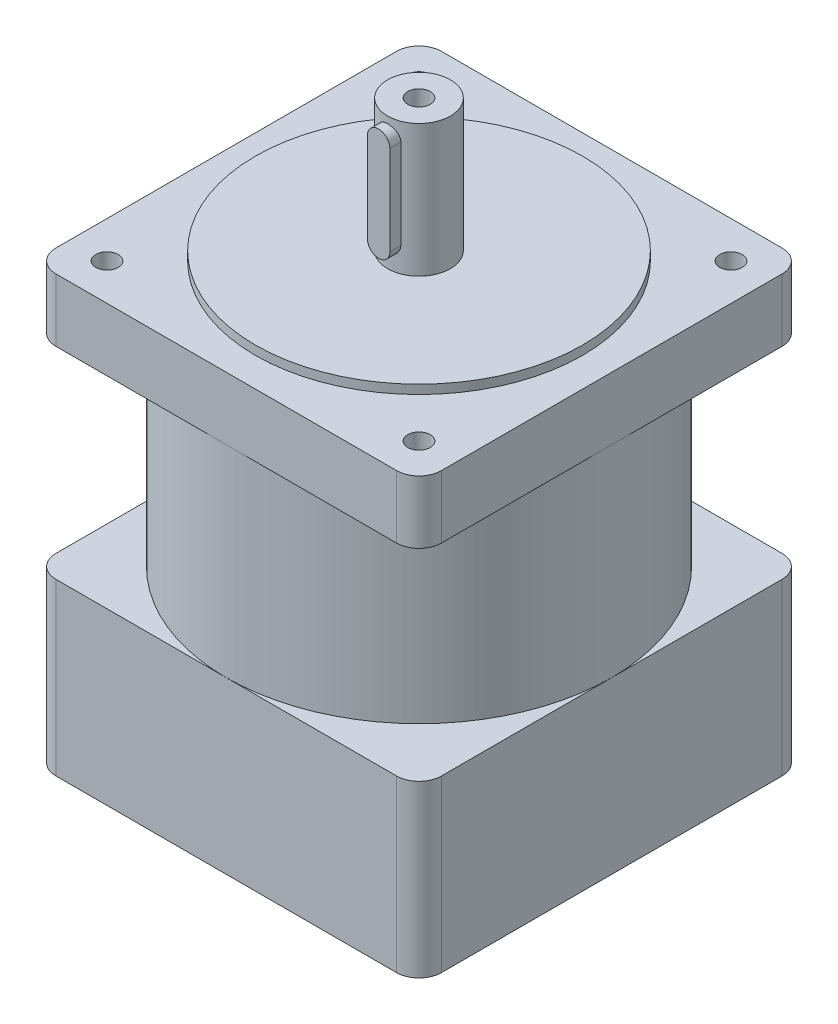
ISO-10303-21;
HEADER;
FILE_DESCRIPTION(('STEP AP214'),'2;1');
FILE_NAME('part.step','',(''),(''),'','','');
FILE_SCHEMA(('AUTOMOTIVE_DESIGN { 1 0 10303 214 1 1 1 1 }'));
ENDSEC;
DATA;
#1=APPLICATION_CONTEXT('core data for automotive mechanical design processes');
#2=APPLICATION_PROTOCOL_DEFINITION('international standard','automotive_design',2000,#1);
#3=PRODUCT_CONTEXT('',#1,'mechanical');
#4=PRODUCT('Part','Part','',(#3));
#5=PRODUCT_RELATED_PRODUCT_CATEGORY('part','',(#4));
#6=PRODUCT_DEFINITION_FORMATION('','',#4);
#7=PRODUCT_DEFINITION_CONTEXT('part definition',#1,'design');
#8=PRODUCT_DEFINITION('design','',#6,#7);
#9=PRODUCT_DEFINITION_SHAPE('','',#8);
#10=(LENGTH_UNIT() NAMED_UNIT(*) SI_UNIT(.MILLI.,.METRE.));
#11=(NAMED_UNIT(*) PLANE_ANGLE_UNIT() SI_UNIT($,.RADIAN.));
#12=(NAMED_UNIT(*) SI_UNIT($,.STERADIAN.) SOLID_ANGLE_UNIT());
#13=UNCERTAINTY_MEASURE_WITH_UNIT(LENGTH_MEASURE(1.E-05),#10,'distance_accuracy_value','');
#14=(GEOMETRIC_REPRESENTATION_CONTEXT(3) GLOBAL_UNCERTAINTY_ASSIGNED_CONTEXT((#13)) GLOBAL_UNIT_ASSIGNED_CONTEXT((#10,
#11,#12)) REPRESENTATION_CONTEXT('',''));
#15=CARTESIAN_POINT('',(0.,0.,0.));
#16=DIRECTION('',(0.,0.,1.));
#17=DIRECTION('',(1.,0.,0.));
#18=AXIS2_PLACEMENT_3D('',#15,#16,#17);
#19=CARTESIAN_POINT('',(0.,0.,0.));
#20=DIRECTION('',(0.,1.,0.));
#21=DIRECTION('',(0.,0.,1.));
#22=AXIS2_PLACEMENT_3D('',#19,#20,#21);
#23=PLANE('',#22);
#24=CARTESIAN_POINT('',(34.8,0.,34.8));
#25=DIRECTION('',(0.,1.,0.));
#26=DIRECTION('',(0.,0.,1.));
#27=AXIS2_PLACEMENT_3D('',#24,#25,#26);
#28=CIRCLE('',#27,2.5);
#29=CARTESIAN_POINT('',(34.8,0.,37.3));
#30=VERTEX_POINT('',#29);
#31=EDGE_CURVE('E1132',#30,#30,#28,.T.);
#32=ORIENTED_EDGE('',*,*,#31,.T.);
#33=EDGE_LOOP('',(#32));
#34=FACE_BOUND('',#33,.T.);
#35=DIRECTION('',(1.,0.,0.));
#36=VECTOR('',#35,1.);
#37=CARTESIAN_POINT('',(-43.,0.,43.));
#38=LINE('',#37,#36);
#39=CARTESIAN_POINT('',(0.,0.,43.));
#40=VERTEX_POINT('',#39);
#41=CARTESIAN_POINT('',(38.,0.,43.));
#42=VERTEX_POINT('',#41);
#43=EDGE_CURVE('E397',#40,#42,#38,.T.);
#44=ORIENTED_EDGE('',*,*,#43,.F.);
#45=CARTESIAN_POINT('',(0.,0.,0.));
#46=DIRECTION('',(0.,1.,0.));
#47=DIRECTION('',(0.,0.,1.));
#48=AXIS2_PLACEMENT_3D('',#45,#46,#47);
#49=CIRCLE('',#48,43.);
#50=CARTESIAN_POINT('',(43.,0.,0.));
#51=VERTEX_POINT('',#50);
#52=EDGE_CURVE('E314',#40,#51,#49,.T.);
#53=ORIENTED_EDGE('',*,*,#52,.T.);
#54=DIRECTION('',(0.,0.,-1.));
#55=VECTOR('',#54,1.);
#56=CARTESIAN_POINT('',(43.,0.,-43.));
#57=LINE('',#56,#55);
#58=CARTESIAN_POINT('',(43.,0.,38.));
#59=VERTEX_POINT('',#58);
#60=EDGE_CURVE('E386',#59,#51,#57,.T.);
#61=ORIENTED_EDGE('',*,*,#60,.F.);
#62=CARTESIAN_POINT('',(38.,0.,38.));
#63=DIRECTION('',(0.,1.,0.));
#64=DIRECTION('',(0.,0.,1.));
#65=AXIS2_PLACEMENT_3D('',#62,#63,#64);
#66=CIRCLE('',#65,5.);
#67=EDGE_CURVE('E407',#59,#42,#66,.F.);
#68=ORIENTED_EDGE('',*,*,#67,.T.);
#69=EDGE_LOOP('',(#44,#53,#61,#68));
#70=FACE_BOUND('',#69,.T.);
#71=ADVANCED_FACE('F39',(#34,#70),#23,.F.);
#72=CARTESIAN_POINT('',(34.8,0.,-34.8));
#73=DIRECTION('',(0.,1.,0.));
#74=DIRECTION('',(0.,0.,1.));
#75=AXIS2_PLACEMENT_3D('',#72,#73,#74);
#76=CIRCLE('',#75,2.5);
#77=CARTESIAN_POINT('',(34.8,0.,-32.3));
#78=VERTEX_POINT('',#77);
#79=EDGE_CURVE('E254',#78,#78,#76,.T.);
#80=ORIENTED_EDGE('',*,*,#79,.T.);
#81=EDGE_LOOP('',(#80));
#82=FACE_BOUND('',#81,.T.);
#83=CARTESIAN_POINT('',(43.,0.,-38.));
#84=VERTEX_POINT('',#83);
#85=EDGE_CURVE('E368',#51,#84,#57,.T.);
#86=ORIENTED_EDGE('',*,*,#85,.F.);
#87=CARTESIAN_POINT('',(0.,0.,-43.));
#88=VERTEX_POINT('',#87);
#89=EDGE_CURVE('E333',#51,#88,#49,.T.);
#90=ORIENTED_EDGE('',*,*,#89,.T.);
#91=DIRECTION('',(-1.,0.,0.));
#92=VECTOR('',#91,1.);
#93=CARTESIAN_POINT('',(-43.,0.,-43.));
#94=LINE('',#93,#92);
#95=CARTESIAN_POINT('',(38.,0.,-43.));
#96=VERTEX_POINT('',#95);
#97=EDGE_CURVE('E390',#96,#88,#94,.T.);
#98=ORIENTED_EDGE('',*,*,#97,.F.);
#99=CARTESIAN_POINT('',(38.,0.,-38.));
#100=DIRECTION('',(0.,1.,0.));
#101=DIRECTION('',(0.,0.,1.));
#102=AXIS2_PLACEMENT_3D('',#99,#100,#101);
#103=CIRCLE('',#102,5.);
#104=EDGE_CURVE('E410',#96,#84,#103,.F.);
#105=ORIENTED_EDGE('',*,*,#104,.T.);
#106=EDGE_LOOP('',(#86,#90,#98,#105));
#107=FACE_BOUND('',#106,.T.);
#108=ADVANCED_FACE('F549',(#82,#107),#23,.F.);
#109=CARTESIAN_POINT('',(-34.8,0.,-34.8));
#110=DIRECTION('',(0.,1.,0.));
#111=DIRECTION('',(0.,0.,1.));
#112=AXIS2_PLACEMENT_3D('',#109,#110,#111);
#113=CIRCLE('',#112,2.5);
#114=CARTESIAN_POINT('',(-34.8,0.,-32.3));
#115=VERTEX_POINT('',#114);
#116=EDGE_CURVE('E587',#115,#115,#113,.T.);
#117=ORIENTED_EDGE('',*,*,#116,.T.);
#118=EDGE_LOOP('',(#117));
#119=FACE_BOUND('',#118,.T.);
#120=CARTESIAN_POINT('',(-38.,0.,-43.));
#121=VERTEX_POINT('',#120);
#122=EDGE_CURVE('E389',#88,#121,#94,.T.);
#123=ORIENTED_EDGE('',*,*,#122,.F.);
#124=CARTESIAN_POINT('',(-43.,0.,0.));
#125=VERTEX_POINT('',#124);
#126=EDGE_CURVE('E591',#88,#125,#49,.T.);
#127=ORIENTED_EDGE('',*,*,#126,.T.);
#128=DIRECTION('',(0.,0.,1.));
#129=VECTOR('',#128,1.);
#130=CARTESIAN_POINT('',(-43.,0.,-43.));
#131=LINE('',#130,#129);
#132=CARTESIAN_POINT('',(-43.,0.,-38.));
#133=VERTEX_POINT('',#132);
#134=EDGE_CURVE('E394',#133,#125,#131,.T.);
#135=ORIENTED_EDGE('',*,*,#134,.F.);
#136=CARTESIAN_POINT('',(-38.,0.,-38.));
#137=DIRECTION('',(0.,1.,0.));
#138=DIRECTION('',(0.,0.,1.));
#139=AXIS2_PLACEMENT_3D('',#136,#137,#138);
#140=CIRCLE('',#139,5.);
#141=EDGE_CURVE('E413',#133,#121,#140,.F.);
#142=ORIENTED_EDGE('',*,*,#141,.T.);
#143=EDGE_LOOP('',(#123,#127,#135,#142));
#144=FACE_BOUND('',#143,.T.);
#145=ADVANCED_FACE('F556',(#119,#144),#23,.F.);
#146=CARTESIAN_POINT('',(0.,45.5,0.));
#147=DIRECTION('',(0.,-1.,0.));
#148=DIRECTION('',(0.,0.,-1.));
#149=AXIS2_PLACEMENT_3D('',#146,#147,#148);
#150=CYLINDRICAL_SURFACE('',#149,7.);
#151=CARTESIAN_POINT('',(0.,45.5,0.));
#152=DIRECTION('',(0.,1.,0.));
#153=DIRECTION('',(0.,0.,1.));
#154=AXIS2_PLACEMENT_3D('',#151,#152,#153);
#155=CIRCLE('',#154,7.);
#156=CARTESIAN_POINT('',(0.,45.5,7.));
#157=VERTEX_POINT('',#156);
#158=EDGE_CURVE('E361',#157,#157,#155,.T.);
#159=ORIENTED_EDGE('',*,*,#158,.F.);
#160=EDGE_LOOP('',(#159));
#161=FACE_BOUND('',#160,.T.);
#162=CARTESIAN_POINT('',(0.,16.,0.));
#163=DIRECTION('',(0.,1.,0.));
#164=DIRECTION('',(0.,0.,1.));
#165=AXIS2_PLACEMENT_3D('',#162,#163,#164);
#166=CIRCLE('',#165,7.);
#167=CARTESIAN_POINT('',(0.,16.,7.));
#168=VERTEX_POINT('',#167);
#169=EDGE_CURVE('E364',#168,#168,#166,.F.);
#170=ORIENTED_EDGE('',*,*,#169,.F.);
#171=EDGE_LOOP('',(#170));
#172=FACE_BOUND('',#171,.T.);
#173=CARTESIAN_POINT('',(-2.5,41.5,6.53834841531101));
#174=CARTESIAN_POINT('',(-2.50000293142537,41.3644729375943,6.53834584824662));
#175=CARTESIAN_POINT('',(-2.48894249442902,41.2289661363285,6.54260813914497));
#176=CARTESIAN_POINT('',(-2.44517096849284,40.9620070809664,6.55909115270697));
#177=CARTESIAN_POINT('',(-2.41245881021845,40.8305550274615,6.57131226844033));
#178=CARTESIAN_POINT('',(-2.32671186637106,40.5756252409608,6.60215581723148));
#179=CARTESIAN_POINT('',(-2.27372177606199,40.4521306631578,6.62076416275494));
#180=CARTESIAN_POINT('',(-2.14907922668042,40.2157391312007,6.66226377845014));
#181=CARTESIAN_POINT('',(-2.0774217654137,40.1028450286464,6.68515619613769));
#182=CARTESIAN_POINT('',(-1.91402447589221,39.8857788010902,6.73379932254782));
#183=CARTESIAN_POINT('',(-1.82158324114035,39.7821521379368,6.75962863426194));
#184=CARTESIAN_POINT('',(-1.62073451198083,39.5914931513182,6.81057580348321));
#185=CARTESIAN_POINT('',(-1.51232401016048,39.504463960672,6.8356935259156));
#186=CARTESIAN_POINT('',(-1.27854087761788,39.3469109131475,6.88331097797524));
#187=CARTESIAN_POINT('',(-1.15275218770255,39.2769705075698,6.90570766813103));
#188=CARTESIAN_POINT('',(-0.890255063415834,39.1594649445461,6.94442306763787));
#189=CARTESIAN_POINT('',(-0.753550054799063,39.1118927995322,6.9607436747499));
#190=CARTESIAN_POINT('',(-0.478828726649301,39.0423590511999,6.98491061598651));
#191=CARTESIAN_POINT('',(-0.341077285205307,39.0194604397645,6.99306609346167));
#192=CARTESIAN_POINT('',(-0.0634617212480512,38.9969316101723,7.00108797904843));
#193=CARTESIAN_POINT('',(0.0764017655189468,38.9972945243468,7.0009568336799));
#194=CARTESIAN_POINT('',(0.347592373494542,39.0207111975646,6.99262260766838));
#195=CARTESIAN_POINT('',(0.479020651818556,39.0427445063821,6.98478254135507));
#196=CARTESIAN_POINT('',(0.736174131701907,39.1071728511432,6.96237851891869));
#197=CARTESIAN_POINT('',(0.861898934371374,39.1495693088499,6.94781409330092));
#198=CARTESIAN_POINT('',(1.10616096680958,39.2540469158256,6.91316507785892));
#199=CARTESIAN_POINT('',(1.22457268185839,39.3163957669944,6.89300594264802));
#200=CARTESIAN_POINT('',(1.44953519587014,39.4587791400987,6.84923357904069));
#201=CARTESIAN_POINT('',(1.55608236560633,39.5388190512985,6.82561929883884));
#202=CARTESIAN_POINT('',(1.76033248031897,39.7193307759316,6.77590353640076));
#203=CARTESIAN_POINT('',(1.85725678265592,39.8206669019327,6.74973657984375));
#204=CARTESIAN_POINT('',(2.03301110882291,40.0383434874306,6.69889962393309));
#205=CARTESIAN_POINT('',(2.11183741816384,40.1546870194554,6.67422993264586));
#206=CARTESIAN_POINT('',(2.25045901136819,40.4018776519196,6.62879124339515));
#207=CARTESIAN_POINT('',(2.30987563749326,40.5329530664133,6.6081027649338));
#208=CARTESIAN_POINT('',(2.40551106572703,40.804179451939,6.57389739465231));
#209=CARTESIAN_POINT('',(2.44174134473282,40.9443258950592,6.56037695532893));
#210=CARTESIAN_POINT('',(2.48828716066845,41.2220838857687,6.54286005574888));
#211=CARTESIAN_POINT('',(2.49982704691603,41.359461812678,6.53841416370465));
#212=CARTESIAN_POINT('',(2.50016897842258,41.6342333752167,6.53828418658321));
#213=CARTESIAN_POINT('',(2.48897597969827,41.7716270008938,6.54259819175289));
#214=CARTESIAN_POINT('',(2.44527599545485,42.0365737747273,6.55904904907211));
#215=CARTESIAN_POINT('',(2.41367185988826,42.1642987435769,6.57085417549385));
#216=CARTESIAN_POINT('',(2.33115923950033,42.4125899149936,6.60057618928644));
#217=CARTESIAN_POINT('',(2.2802470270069,42.5331547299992,6.6184942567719));
#218=CARTESIAN_POINT('',(2.15854403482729,42.7684001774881,6.65919897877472));
#219=CARTESIAN_POINT('',(2.08711845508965,42.8827259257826,6.68213439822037));
#220=CARTESIAN_POINT('',(1.92711056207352,43.098207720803,6.73002297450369));
#221=CARTESIAN_POINT('',(1.83852249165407,43.1993593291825,6.75497680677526));
#222=CARTESIAN_POINT('',(1.64077043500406,43.3915426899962,6.80579566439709));
#223=CARTESIAN_POINT('',(1.53072651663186,43.4816793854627,6.83163247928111));
#224=CARTESIAN_POINT('',(1.29643714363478,43.6422926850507,6.87993729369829));
#225=CARTESIAN_POINT('',(1.1721919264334,43.7127696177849,6.90240534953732));
#226=CARTESIAN_POINT('',(0.913380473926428,43.8315002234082,6.94137984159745));
#227=CARTESIAN_POINT('',(0.778870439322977,43.8798660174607,6.95791626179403));
#228=CARTESIAN_POINT('',(0.50290689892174,43.9530468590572,6.9832833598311));
#229=CARTESIAN_POINT('',(0.361456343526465,43.9778718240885,6.99211728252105));
#230=CARTESIAN_POINT('',(0.0837575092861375,44.0022729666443,7.0008038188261));
#231=CARTESIAN_POINT('',(-0.0523654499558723,44.0031261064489,7.00111065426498));
#232=CARTESIAN_POINT('',(-0.322726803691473,43.9827846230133,6.99386365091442));
#233=CARTESIAN_POINT('',(-0.456965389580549,43.9615922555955,6.98631061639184));
#234=CARTESIAN_POINT('',(-0.716981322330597,43.8986398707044,6.96438311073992));
#235=CARTESIAN_POINT('',(-0.842875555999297,43.8573092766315,6.95015128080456));
#236=CARTESIAN_POINT('',(-1.08597143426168,43.7556669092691,6.91633887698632));
#237=CARTESIAN_POINT('',(-1.20317144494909,43.6953515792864,6.8967573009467));
#238=CARTESIAN_POINT('',(-1.43068233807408,43.5546886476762,6.85325490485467));
#239=CARTESIAN_POINT('',(-1.54052934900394,43.4736355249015,6.82919171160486));
#240=CARTESIAN_POINT('',(-1.74546847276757,43.2949475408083,6.77971046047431));
#241=CARTESIAN_POINT('',(-1.84055552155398,43.1973070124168,6.75429194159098));
#242=CARTESIAN_POINT('',(-2.01782220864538,42.9827811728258,6.70352883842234));
#243=CARTESIAN_POINT('',(-2.09919180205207,42.8652101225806,6.67824313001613));
#244=CARTESIAN_POINT('',(-2.24100798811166,42.6172615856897,6.63200351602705));
#245=CARTESIAN_POINT('',(-2.30145599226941,42.4868849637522,6.61104931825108));
#246=CARTESIAN_POINT('',(-2.39953333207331,42.2162590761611,6.57609213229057));
#247=CARTESIAN_POINT('',(-2.43706721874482,42.0759711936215,6.56211826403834));
#248=CARTESIAN_POINT('',(-2.48729274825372,41.7904461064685,6.54325005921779));
#249=CARTESIAN_POINT('',(-2.4999968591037,41.6452114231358,6.53835116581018));
#250=CARTESIAN_POINT('',(-2.5,41.5,6.53834841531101));
#251=B_SPLINE_CURVE_WITH_KNOTS('',3,(#173,#174,#175,#176,#177,#178,#179,#180,#181,#182,#183,
#184,#185,#186,#187,#188,#189,#190,#191,#192,#193,#194,#195,#196,#197,#198,#199,#200,#201,#202,
#203,#204,#205,#206,#207,#208,#209,#210,#211,#212,#213,#214,#215,#216,#217,#218,#219,#220,#221,
#222,#223,#224,#225,#226,#227,#228,#229,#230,#231,#232,#233,#234,#235,#236,#237,#238,#239,#240,
#241,#242,#243,#244,#245,#246,#247,#248,#249,#250),.UNSPECIFIED.,.T.,.F.,(4,2,2,2,2,2,2,2,2,2,2,
2,2,2,2,2,2,2,2,2,2,2,2,2,2,2,2,2,2,2,2,2,2,2,2,2,2,2,4),(0.,0.406041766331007,
0.812103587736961,1.21727550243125,1.62255610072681,2.04441002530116,2.46634349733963,
2.90112813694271,3.33577686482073,3.75326460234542,4.17062908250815,4.56923737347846,
4.96787349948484,5.37209971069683,5.77644923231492,6.20244167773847,6.62852147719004,
7.06247609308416,7.4962157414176,7.90789453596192,8.31948358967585,8.71400941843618,
9.10861145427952,9.51705885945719,9.92564351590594,10.3573204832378,10.7889902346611,
11.2184461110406,11.6477209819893,12.0540827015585,12.4604028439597,12.8584146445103,
13.2565010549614,13.67053016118,14.0847010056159,14.5182116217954,14.9516929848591,
15.386967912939,15.8220242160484),.UNSPECIFIED.);
#252=CARTESIAN_POINT('',(2.5,41.5,6.53834841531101));
#253=VERTEX_POINT('',#252);
#254=CARTESIAN_POINT('',(-2.5,41.5,6.53834841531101));
#255=VERTEX_POINT('',#254);
#256=EDGE_CURVE('E474',#253,#255,#251,.T.);
#257=ORIENTED_EDGE('',*,*,#256,.F.);
#258=DIRECTION('',(0.,-1.,0.));
#259=VECTOR('',#258,1.);
#260=CARTESIAN_POINT('',(2.5,45.5,6.53834841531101));
#261=LINE('',#260,#259);
#262=CARTESIAN_POINT('',(2.5,21.5,6.53834841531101));
#263=VERTEX_POINT('',#262);
#264=EDGE_CURVE('E439',#263,#253,#261,.F.);
#265=ORIENTED_EDGE('',*,*,#264,.F.);
#266=CARTESIAN_POINT('',(-2.5,21.5,6.53834841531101));
#267=CARTESIAN_POINT('',(-2.50000293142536,21.3644729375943,6.53834584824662));
#268=CARTESIAN_POINT('',(-2.48894249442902,21.2289661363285,6.54260813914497));
#269=CARTESIAN_POINT('',(-2.44517096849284,20.9620070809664,6.55909115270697));
#270=CARTESIAN_POINT('',(-2.41245881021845,20.8305550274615,6.57131226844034));
#271=CARTESIAN_POINT('',(-2.32671186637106,20.5756252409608,6.60215581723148));
#272=CARTESIAN_POINT('',(-2.27372177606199,20.4521306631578,6.62076416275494));
#273=CARTESIAN_POINT('',(-2.14907922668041,20.2157391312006,6.66226377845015));
#274=CARTESIAN_POINT('',(-2.0774217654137,20.1028450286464,6.68515619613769));
#275=CARTESIAN_POINT('',(-1.91402447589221,19.8857788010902,6.73379932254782));
#276=CARTESIAN_POINT('',(-1.82158324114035,19.7821521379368,6.75962863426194));
#277=CARTESIAN_POINT('',(-1.62073451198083,19.5914931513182,6.81057580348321));
#278=CARTESIAN_POINT('',(-1.51232401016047,19.504463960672,6.8356935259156));
#279=CARTESIAN_POINT('',(-1.27854087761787,19.3469109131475,6.88331097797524));
#280=CARTESIAN_POINT('',(-1.15275218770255,19.2769705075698,6.90570766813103));
#281=CARTESIAN_POINT('',(-0.890255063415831,19.1594649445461,6.94442306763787));
#282=CARTESIAN_POINT('',(-0.753550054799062,19.1118927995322,6.9607436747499));
#283=CARTESIAN_POINT('',(-0.478828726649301,19.0423590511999,6.98491061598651));
#284=CARTESIAN_POINT('',(-0.341077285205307,19.0194604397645,6.99306609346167));
#285=CARTESIAN_POINT('',(-0.0634617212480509,18.9969316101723,7.00108797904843));
#286=CARTESIAN_POINT('',(0.0764017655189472,18.9972945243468,7.0009568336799));
#287=CARTESIAN_POINT('',(0.347592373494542,19.0207111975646,6.99262260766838));
#288=CARTESIAN_POINT('',(0.479020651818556,19.0427445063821,6.98478254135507));
#289=CARTESIAN_POINT('',(0.736174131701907,19.1071728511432,6.96237851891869));
#290=CARTESIAN_POINT('',(0.861898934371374,19.1495693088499,6.94781409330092));
#291=CARTESIAN_POINT('',(1.10616096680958,19.2540469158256,6.91316507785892));
#292=CARTESIAN_POINT('',(1.22457268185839,19.3163957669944,6.89300594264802));
#293=CARTESIAN_POINT('',(1.44953519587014,19.4587791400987,6.84923357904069));
#294=CARTESIAN_POINT('',(1.55608236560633,19.5388190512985,6.82561929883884));
#295=CARTESIAN_POINT('',(1.76033248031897,19.7193307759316,6.77590353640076));
#296=CARTESIAN_POINT('',(1.85725678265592,19.8206669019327,6.74973657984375));
#297=CARTESIAN_POINT('',(2.03301110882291,20.0383434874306,6.69889962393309));
#298=CARTESIAN_POINT('',(2.11183741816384,20.1546870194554,6.67422993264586));
#299=CARTESIAN_POINT('',(2.25045901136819,20.4018776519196,6.62879124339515));
#300=CARTESIAN_POINT('',(2.30987563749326,20.5329530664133,6.6081027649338));
#301=CARTESIAN_POINT('',(2.40551106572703,20.804179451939,6.57389739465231));
#302=CARTESIAN_POINT('',(2.44174134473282,20.9443258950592,6.56037695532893));
#303=CARTESIAN_POINT('',(2.48828716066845,21.2220838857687,6.54286005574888));
#304=CARTESIAN_POINT('',(2.49982704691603,21.359461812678,6.53841416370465));
#305=CARTESIAN_POINT('',(2.50016897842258,21.6342333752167,6.53828418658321));
#306=CARTESIAN_POINT('',(2.48897597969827,21.7716270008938,6.54259819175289));
#307=CARTESIAN_POINT('',(2.44527599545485,22.0365737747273,6.55904904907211));
#308=CARTESIAN_POINT('',(2.41367185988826,22.1642987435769,6.57085417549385));
#309=CARTESIAN_POINT('',(2.33115923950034,22.4125899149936,6.60057618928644));
#310=CARTESIAN_POINT('',(2.2802470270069,22.5331547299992,6.6184942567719));
#311=CARTESIAN_POINT('',(2.15854403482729,22.7684001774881,6.65919897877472));
#312=CARTESIAN_POINT('',(2.08711845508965,22.8827259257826,6.68213439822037));
#313=CARTESIAN_POINT('',(1.92711056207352,23.098207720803,6.73002297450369));
#314=CARTESIAN_POINT('',(1.83852249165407,23.1993593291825,6.75497680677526));
#315=CARTESIAN_POINT('',(1.64077043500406,23.3915426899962,6.80579566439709));
#316=CARTESIAN_POINT('',(1.53072651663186,23.4816793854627,6.83163247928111));
#317=CARTESIAN_POINT('',(1.29643714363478,23.6422926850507,6.87993729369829));
#318=CARTESIAN_POINT('',(1.17219192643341,23.7127696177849,6.90240534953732));
#319=CARTESIAN_POINT('',(0.91338047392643,23.8315002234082,6.94137984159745));
#320=CARTESIAN_POINT('',(0.778870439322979,23.8798660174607,6.95791626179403));
#321=CARTESIAN_POINT('',(0.502906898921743,23.9530468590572,6.9832833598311));
#322=CARTESIAN_POINT('',(0.361456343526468,23.9778718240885,6.99211728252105));
#323=CARTESIAN_POINT('',(0.0837575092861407,24.0022729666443,7.0008038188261));
#324=CARTESIAN_POINT('',(-0.0523654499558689,24.0031261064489,7.00111065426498));
#325=CARTESIAN_POINT('',(-0.322726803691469,23.9827846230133,6.99386365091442));
#326=CARTESIAN_POINT('',(-0.456965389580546,23.9615922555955,6.98631061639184));
#327=CARTESIAN_POINT('',(-0.716981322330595,23.8986398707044,6.96438311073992));
#328=CARTESIAN_POINT('',(-0.842875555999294,23.8573092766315,6.95015128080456));
#329=CARTESIAN_POINT('',(-1.08597143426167,23.7556669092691,6.91633887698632));
#330=CARTESIAN_POINT('',(-1.20317144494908,23.6953515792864,6.8967573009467));
#331=CARTESIAN_POINT('',(-1.43068233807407,23.5546886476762,6.85325490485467));
#332=CARTESIAN_POINT('',(-1.54052934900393,23.4736355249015,6.82919171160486));
#333=CARTESIAN_POINT('',(-1.74546847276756,23.2949475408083,6.77971046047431));
#334=CARTESIAN_POINT('',(-1.84055552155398,23.1973070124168,6.75429194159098));
#335=CARTESIAN_POINT('',(-2.01782220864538,22.9827811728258,6.70352883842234));
#336=CARTESIAN_POINT('',(-2.09919180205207,22.8652101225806,6.67824313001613));
#337=CARTESIAN_POINT('',(-2.24100798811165,22.6172615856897,6.63200351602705));
#338=CARTESIAN_POINT('',(-2.30145599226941,22.4868849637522,6.61104931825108));
#339=CARTESIAN_POINT('',(-2.39953333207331,22.2162590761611,6.57609213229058));
#340=CARTESIAN_POINT('',(-2.43706721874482,22.0759711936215,6.56211826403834));
#341=CARTESIAN_POINT('',(-2.48729274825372,21.7904461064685,6.54325005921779));
#342=CARTESIAN_POINT('',(-2.49999685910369,21.6452114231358,6.53835116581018));
#343=CARTESIAN_POINT('',(-2.5,21.5,6.53834841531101));
#344=B_SPLINE_CURVE_WITH_KNOTS('',3,(#266,#267,#268,#269,#270,#271,#272,#273,#274,#275,#276,
#277,#278,#279,#280,#281,#282,#283,#284,#285,#286,#287,#288,#289,#290,#291,#292,#293,#294,#295,
#296,#297,#298,#299,#300,#301,#302,#303,#304,#305,#306,#307,#308,#309,#310,#311,#312,#313,#314,
#315,#316,#317,#318,#319,#320,#321,#322,#323,#324,#325,#326,#327,#328,#329,#330,#331,#332,#333,
#334,#335,#336,#337,#338,#339,#340,#341,#342,#343),.UNSPECIFIED.,.T.,.F.,(4,2,2,2,2,2,2,2,2,2,2,
2,2,2,2,2,2,2,2,2,2,2,2,2,2,2,2,2,2,2,2,2,2,2,2,2,2,2,4),(0.,0.406041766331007,
0.812103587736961,1.21727550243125,1.62255610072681,2.04441002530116,2.46634349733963,
2.90112813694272,3.33577686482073,3.75326460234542,4.17062908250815,4.56923737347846,
4.96787349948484,5.37209971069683,5.77644923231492,6.20244167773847,6.62852147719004,
7.06247609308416,7.49621574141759,7.90789453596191,8.31948358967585,8.71400941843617,
9.10861145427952,9.51705885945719,9.92564351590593,10.3573204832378,10.7889902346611,
11.2184461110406,11.6477209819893,12.0540827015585,12.4604028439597,12.8584146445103,
13.2565010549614,13.67053016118,14.0847010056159,14.5182116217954,14.9516929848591,
15.386967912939,15.8220242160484),.UNSPECIFIED.);
#345=CARTESIAN_POINT('',(-2.5,21.5,6.53834841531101));
#346=VERTEX_POINT('',#345);
#347=EDGE_CURVE('E444',#346,#263,#344,.T.);
#348=ORIENTED_EDGE('',*,*,#347,.F.);
#349=DIRECTION('',(0.,-1.,0.));
#350=VECTOR('',#349,1.);
#351=CARTESIAN_POINT('',(-2.5,45.5,6.53834841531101));
#352=LINE('',#351,#350);
#353=EDGE_CURVE('E451',#255,#346,#352,.T.);
#354=ORIENTED_EDGE('',*,*,#353,.F.);
#355=EDGE_LOOP('',(#257,#265,#348,#354));
#356=FACE_BOUND('',#355,.T.);
#357=ADVANCED_FACE('F453',(#161,#172,#356),#150,.T.);
#358=CARTESIAN_POINT('',(0.,16.,0.));
#359=DIRECTION('',(0.,1.,0.));
#360=DIRECTION('',(0.,0.,1.));
#361=AXIS2_PLACEMENT_3D('',#358,#359,#360);
#362=PLANE('',#361);
#363=CARTESIAN_POINT('',(0.,16.,0.));
#364=DIRECTION('',(0.,1.,0.));
#365=DIRECTION('',(0.,0.,1.));
#366=AXIS2_PLACEMENT_3D('',#363,#364,#365);
#367=CIRCLE('',#366,36.5);
#368=CARTESIAN_POINT('',(0.,16.,36.5));
#369=VERTEX_POINT('',#368);
#370=EDGE_CURVE('E365',#369,#369,#367,.T.);
#371=ORIENTED_EDGE('',*,*,#370,.T.);
#372=EDGE_LOOP('',(#371));
#373=FACE_BOUND('',#372,.T.);
#374=ORIENTED_EDGE('',*,*,#169,.T.);
#375=EDGE_LOOP('',(#374));
#376=FACE_BOUND('',#375,.T.);
#377=ADVANCED_FACE('F582',(#373,#376),#362,.T.);
#378=CARTESIAN_POINT('',(0.,14.,0.));
#379=DIRECTION('',(0.,1.,0.));
#380=DIRECTION('',(0.,0.,1.));
#381=AXIS2_PLACEMENT_3D('',#378,#379,#380);
#382=PLANE('',#381);
#383=CARTESIAN_POINT('',(-34.8,14.,-34.8));
#384=DIRECTION('',(0.,1.,0.));
#385=DIRECTION('',(0.,0.,1.));
#386=AXIS2_PLACEMENT_3D('',#383,#384,#385);
#387=CIRCLE('',#386,2.5);
#388=CARTESIAN_POINT('',(-34.8,14.,-32.3));
#389=VERTEX_POINT('',#388);
#390=EDGE_CURVE('E1119',#389,#389,#387,.T.);
#391=ORIENTED_EDGE('',*,*,#390,.F.);
#392=EDGE_LOOP('',(#391));
#393=FACE_BOUND('',#392,.T.);
#394=CARTESIAN_POINT('',(-34.8,14.,34.8));
#395=DIRECTION('',(0.,1.,0.));
#396=DIRECTION('',(0.,0.,1.));
#397=AXIS2_PLACEMENT_3D('',#394,#395,#396);
#398=CIRCLE('',#397,2.5);
#399=CARTESIAN_POINT('',(-34.8,14.,37.3));
#400=VERTEX_POINT('',#399);
#401=EDGE_CURVE('E1123',#400,#400,#398,.T.);
#402=ORIENTED_EDGE('',*,*,#401,.F.);
#403=EDGE_LOOP('',(#402));
#404=FACE_BOUND('',#403,.T.);
#405=CARTESIAN_POINT('',(34.8,14.,34.8));
#406=DIRECTION('',(0.,1.,0.));
#407=DIRECTION('',(0.,0.,1.));
#408=AXIS2_PLACEMENT_3D('',#405,#406,#407);
#409=CIRCLE('',#408,2.5);
#410=CARTESIAN_POINT('',(34.8,14.,37.3));
#411=VERTEX_POINT('',#410);
#412=EDGE_CURVE('E1127',#411,#411,#409,.T.);
#413=ORIENTED_EDGE('',*,*,#412,.F.);
#414=EDGE_LOOP('',(#413));
#415=FACE_BOUND('',#414,.T.);
#416=CARTESIAN_POINT('',(34.8,14.,-34.8));
#417=DIRECTION('',(0.,1.,0.));
#418=DIRECTION('',(0.,0.,1.));
#419=AXIS2_PLACEMENT_3D('',#416,#417,#418);
#420=CIRCLE('',#419,2.5);
#421=CARTESIAN_POINT('',(34.8,14.,-32.3));
#422=VERTEX_POINT('',#421);
#423=EDGE_CURVE('E1130',#422,#422,#420,.T.);
#424=ORIENTED_EDGE('',*,*,#423,.F.);
#425=EDGE_LOOP('',(#424));
#426=FACE_BOUND('',#425,.T.);
#427=DIRECTION('',(-1.,0.,0.));
#428=VECTOR('',#427,1.);
#429=CARTESIAN_POINT('',(-43.,14.,-43.));
#430=LINE('',#429,#428);
#431=CARTESIAN_POINT('',(38.,14.,-43.));
#432=VERTEX_POINT('',#431);
#433=CARTESIAN_POINT('',(-38.,14.,-43.));
#434=VERTEX_POINT('',#433);
#435=EDGE_CURVE('E375',#432,#434,#430,.T.);
#436=ORIENTED_EDGE('',*,*,#435,.T.);
#437=CARTESIAN_POINT('',(-38.,14.,-38.));
#438=DIRECTION('',(0.,1.,0.));
#439=DIRECTION('',(0.,0.,1.));
#440=AXIS2_PLACEMENT_3D('',#437,#438,#439);
#441=CIRCLE('',#440,5.);
#442=CARTESIAN_POINT('',(-43.,14.,-38.));
#443=VERTEX_POINT('',#442);
#444=EDGE_CURVE('E427',#434,#443,#441,.T.);
#445=ORIENTED_EDGE('',*,*,#444,.T.);
#446=DIRECTION('',(0.,0.,1.));
#447=VECTOR('',#446,1.);
#448=CARTESIAN_POINT('',(-43.,14.,-43.));
#449=LINE('',#448,#447);
#450=CARTESIAN_POINT('',(-43.,14.,38.));
#451=VERTEX_POINT('',#450);
#452=EDGE_CURVE('E379',#443,#451,#449,.T.);
#453=ORIENTED_EDGE('',*,*,#452,.T.);
#454=CARTESIAN_POINT('',(-38.,14.,38.));
#455=DIRECTION('',(0.,1.,0.));
#456=DIRECTION('',(0.,0.,1.));
#457=AXIS2_PLACEMENT_3D('',#454,#455,#456);
#458=CIRCLE('',#457,5.);
#459=CARTESIAN_POINT('',(-38.,14.,43.));
#460=VERTEX_POINT('',#459);
#461=EDGE_CURVE('E421',#451,#460,#458,.T.);
#462=ORIENTED_EDGE('',*,*,#461,.T.);
#463=DIRECTION('',(1.,0.,0.));
#464=VECTOR('',#463,1.);
#465=CARTESIAN_POINT('',(-43.,14.,43.));
#466=LINE('',#465,#464);
#467=CARTESIAN_POINT('',(38.,14.,43.));
#468=VERTEX_POINT('',#467);
#469=EDGE_CURVE('E382',#460,#468,#466,.T.);
#470=ORIENTED_EDGE('',*,*,#469,.T.);
#471=CARTESIAN_POINT('',(38.,14.,38.));
#472=DIRECTION('',(0.,1.,0.));
#473=DIRECTION('',(0.,0.,1.));
#474=AXIS2_PLACEMENT_3D('',#471,#472,#473);
#475=CIRCLE('',#474,5.);
#476=CARTESIAN_POINT('',(43.,14.,38.));
#477=VERTEX_POINT('',#476);
#478=EDGE_CURVE('E423',#468,#477,#475,.T.);
#479=ORIENTED_EDGE('',*,*,#478,.T.);
#480=DIRECTION('',(0.,0.,-1.));
#481=VECTOR('',#480,1.);
#482=CARTESIAN_POINT('',(43.,14.,-43.));
#483=LINE('',#482,#481);
#484=CARTESIAN_POINT('',(43.,14.,-38.));
#485=VERTEX_POINT('',#484);
#486=EDGE_CURVE('E372',#477,#485,#483,.T.);
#487=ORIENTED_EDGE('',*,*,#486,.T.);
#488=CARTESIAN_POINT('',(38.,14.,-38.));
#489=DIRECTION('',(0.,1.,0.));
#490=DIRECTION('',(0.,0.,1.));
#491=AXIS2_PLACEMENT_3D('',#488,#489,#490);
#492=CIRCLE('',#491,5.);
#493=EDGE_CURVE('E425',#485,#432,#492,.T.);
#494=ORIENTED_EDGE('',*,*,#493,.T.);
#495=EDGE_LOOP('',(#436,#445,#453,#462,#470,#479,#487,#494));
#496=FACE_BOUND('',#495,.T.);
#497=CARTESIAN_POINT('',(0.,14.,0.));
#498=DIRECTION('',(0.,1.,0.));
#499=DIRECTION('',(0.,0.,1.));
#500=AXIS2_PLACEMENT_3D('',#497,#498,#499);
#501=CIRCLE('',#500,36.5);
#502=CARTESIAN_POINT('',(0.,14.,36.5));
#503=VERTEX_POINT('',#502);
#504=EDGE_CURVE('E369',#503,#503,#501,.T.);
#505=ORIENTED_EDGE('',*,*,#504,.F.);
#506=EDGE_LOOP('',(#505));
#507=FACE_BOUND('',#506,.T.);
#508=ADVANCED_FACE('F619',(#393,#404,#415,#426,#496,#507),#382,.T.);
#509=CARTESIAN_POINT('',(43.,14.,-43.));
#510=DIRECTION('',(-1.,0.,0.));
#511=DIRECTION('',(0.,0.,1.));
#512=AXIS2_PLACEMENT_3D('',#509,#510,#511);
#513=PLANE('',#512);
#514=ORIENTED_EDGE('',*,*,#60,.T.);
#515=ORIENTED_EDGE('',*,*,#85,.T.);
#516=DIRECTION('',(0.,-1.,0.));
#517=VECTOR('',#516,1.);
#518=CARTESIAN_POINT('',(43.,14.,-38.));
#519=LINE('',#518,#517);
#520=EDGE_CURVE('E432',#84,#485,#519,.F.);
#521=ORIENTED_EDGE('',*,*,#520,.T.);
#522=ORIENTED_EDGE('',*,*,#486,.F.);
#523=DIRECTION('',(0.,-1.,0.));
#524=VECTOR('',#523,1.);
#525=CARTESIAN_POINT('',(43.,14.,38.));
#526=LINE('',#525,#524);
#527=EDGE_CURVE('E429',#477,#59,#526,.T.);
#528=ORIENTED_EDGE('',*,*,#527,.T.);
#529=EDGE_LOOP('',(#514,#515,#521,#522,#528));
#530=FACE_BOUND('',#529,.T.);
#531=ADVANCED_FACE('F626',(#530),#513,.F.);
#532=CARTESIAN_POINT('',(-43.,14.,-43.));
#533=DIRECTION('',(0.,0.,1.));
#534=DIRECTION('',(1.,0.,0.));
#535=AXIS2_PLACEMENT_3D('',#532,#533,#534);
#536=PLANE('',#535);
#537=ORIENTED_EDGE('',*,*,#97,.T.);
#538=ORIENTED_EDGE('',*,*,#122,.T.);
#539=DIRECTION('',(0.,-1.,0.));
#540=VECTOR('',#539,1.);
#541=CARTESIAN_POINT('',(-38.,14.,-43.));
#542=LINE('',#541,#540);
#543=EDGE_CURVE('E419',#121,#434,#542,.F.);
#544=ORIENTED_EDGE('',*,*,#543,.T.);
#545=ORIENTED_EDGE('',*,*,#435,.F.);
#546=DIRECTION('',(0.,-1.,0.));
#547=VECTOR('',#546,1.);
#548=CARTESIAN_POINT('',(38.,14.,-43.));
#549=LINE('',#548,#547);
#550=EDGE_CURVE('E416',#432,#96,#549,.T.);
#551=ORIENTED_EDGE('',*,*,#550,.T.);
#552=EDGE_LOOP('',(#537,#538,#544,#545,#551));
#553=FACE_BOUND('',#552,.T.);
#554=ADVANCED_FACE('F596',(#553),#536,.F.);
#555=CARTESIAN_POINT('',(-43.,14.,-43.));
#556=DIRECTION('',(1.,0.,0.));
#557=DIRECTION('',(0.,0.,-1.));
#558=AXIS2_PLACEMENT_3D('',#555,#556,#557);
#559=PLANE('',#558);
#560=ORIENTED_EDGE('',*,*,#452,.F.);
#561=DIRECTION('',(0.,-1.,0.));
#562=VECTOR('',#561,1.);
#563=CARTESIAN_POINT('',(-43.,14.,-38.));
#564=LINE('',#563,#562);
#565=EDGE_CURVE('E401',#443,#133,#564,.T.);
#566=ORIENTED_EDGE('',*,*,#565,.T.);
#567=ORIENTED_EDGE('',*,*,#134,.T.);
#568=CARTESIAN_POINT('',(-43.,0.,38.));
#569=VERTEX_POINT('',#568);
#570=EDGE_CURVE('E393',#125,#569,#131,.T.);
#571=ORIENTED_EDGE('',*,*,#570,.T.);
#572=DIRECTION('',(0.,-1.,0.));
#573=VECTOR('',#572,1.);
#574=CARTESIAN_POINT('',(-43.,14.,38.));
#575=LINE('',#574,#573);
#576=EDGE_CURVE('E385',#569,#451,#575,.F.);
#577=ORIENTED_EDGE('',*,*,#576,.T.);
#578=EDGE_LOOP('',(#560,#566,#567,#571,#577));
#579=FACE_BOUND('',#578,.T.);
#580=ADVANCED_FACE('F573',(#579),#559,.F.);
#581=CARTESIAN_POINT('',(-43.,14.,43.));
#582=DIRECTION('',(0.,0.,-1.));
#583=DIRECTION('',(-1.,0.,0.));
#584=AXIS2_PLACEMENT_3D('',#581,#582,#583);
#585=PLANE('',#584);
#586=CARTESIAN_POINT('',(-38.,0.,43.));
#587=VERTEX_POINT('',#586);
#588=EDGE_CURVE('E376',#587,#40,#38,.T.);
#589=ORIENTED_EDGE('',*,*,#588,.T.);
#590=ORIENTED_EDGE('',*,*,#43,.T.);
#591=DIRECTION('',(0.,-1.,0.));
#592=VECTOR('',#591,1.);
#593=CARTESIAN_POINT('',(38.,14.,43.));
#594=LINE('',#593,#592);
#595=EDGE_CURVE('E437',#42,#468,#594,.F.);
#596=ORIENTED_EDGE('',*,*,#595,.T.);
#597=ORIENTED_EDGE('',*,*,#469,.F.);
#598=DIRECTION('',(0.,-1.,0.));
#599=VECTOR('',#598,1.);
#600=CARTESIAN_POINT('',(-38.,14.,43.));
#601=LINE('',#600,#599);
#602=EDGE_CURVE('E434',#460,#587,#601,.T.);
#603=ORIENTED_EDGE('',*,*,#602,.T.);
#604=EDGE_LOOP('',(#589,#590,#596,#597,#603));
#605=FACE_BOUND('',#604,.T.);
#606=ADVANCED_FACE('F564',(#605),#585,.F.);
#607=CARTESIAN_POINT('',(-34.8,0.,34.8));
#608=DIRECTION('',(0.,1.,0.));
#609=DIRECTION('',(0.,0.,1.));
#610=AXIS2_PLACEMENT_3D('',#607,#608,#609);
#611=CIRCLE('',#610,2.5);
#612=CARTESIAN_POINT('',(-34.8,0.,37.3));
#613=VERTEX_POINT('',#612);
#614=EDGE_CURVE('E1138',#613,#613,#611,.T.);
#615=ORIENTED_EDGE('',*,*,#614,.T.);
#616=EDGE_LOOP('',(#615));
#617=FACE_BOUND('',#616,.T.);
#618=ORIENTED_EDGE('',*,*,#570,.F.);
#619=EDGE_CURVE('E334',#125,#40,#49,.T.);
#620=ORIENTED_EDGE('',*,*,#619,.T.);
#621=ORIENTED_EDGE('',*,*,#588,.F.);
#622=CARTESIAN_POINT('',(-38.,0.,38.));
#623=DIRECTION('',(0.,1.,0.));
#624=DIRECTION('',(0.,0.,1.));
#625=AXIS2_PLACEMENT_3D('',#622,#623,#624);
#626=CIRCLE('',#625,5.);
#627=EDGE_CURVE('E404',#587,#569,#626,.F.);
#628=ORIENTED_EDGE('',*,*,#627,.T.);
#629=EDGE_LOOP('',(#618,#620,#621,#628));
#630=FACE_BOUND('',#629,.T.);
#631=ADVANCED_FACE('F552',(#617,#630),#23,.F.);
#632=CARTESIAN_POINT('',(-38.,14.,-38.));
#633=DIRECTION('',(0.,-1.,0.));
#634=DIRECTION('',(0.,0.,-1.));
#635=AXIS2_PLACEMENT_3D('',#632,#633,#634);
#636=CYLINDRICAL_SURFACE('',#635,5.);
#637=ORIENTED_EDGE('',*,*,#444,.F.);
#638=ORIENTED_EDGE('',*,*,#543,.F.);
#639=ORIENTED_EDGE('',*,*,#141,.F.);
#640=ORIENTED_EDGE('',*,*,#565,.F.);
#641=EDGE_LOOP('',(#637,#638,#639,#640));
#642=FACE_BOUND('',#641,.T.);
#643=ADVANCED_FACE('F563',(#642),#636,.T.);
#644=CARTESIAN_POINT('',(38.,14.,-38.));
#645=DIRECTION('',(0.,-1.,0.));
#646=DIRECTION('',(0.,0.,-1.));
#647=AXIS2_PLACEMENT_3D('',#644,#645,#646);
#648=CYLINDRICAL_SURFACE('',#647,5.);
#649=ORIENTED_EDGE('',*,*,#493,.F.);
#650=ORIENTED_EDGE('',*,*,#520,.F.);
#651=ORIENTED_EDGE('',*,*,#104,.F.);
#652=ORIENTED_EDGE('',*,*,#550,.F.);
#653=EDGE_LOOP('',(#649,#650,#651,#652));
#654=FACE_BOUND('',#653,.T.);
#655=ADVANCED_FACE('F570',(#654),#648,.T.);
#656=CARTESIAN_POINT('',(38.,14.,38.));
#657=DIRECTION('',(0.,-1.,0.));
#658=DIRECTION('',(0.,0.,-1.));
#659=AXIS2_PLACEMENT_3D('',#656,#657,#658);
#660=CYLINDRICAL_SURFACE('',#659,5.);
#661=ORIENTED_EDGE('',*,*,#478,.F.);
#662=ORIENTED_EDGE('',*,*,#595,.F.);
#663=ORIENTED_EDGE('',*,*,#67,.F.);
#664=ORIENTED_EDGE('',*,*,#527,.F.);
#665=EDGE_LOOP('',(#661,#662,#663,#664));
#666=FACE_BOUND('',#665,.T.);
#667=ADVANCED_FACE('F630',(#666),#660,.T.);
#668=CARTESIAN_POINT('',(-38.,14.,38.));
#669=DIRECTION('',(0.,-1.,0.));
#670=DIRECTION('',(0.,0.,-1.));
#671=AXIS2_PLACEMENT_3D('',#668,#669,#670);
#672=CYLINDRICAL_SURFACE('',#671,5.);
#673=ORIENTED_EDGE('',*,*,#461,.F.);
#674=ORIENTED_EDGE('',*,*,#576,.F.);
#675=ORIENTED_EDGE('',*,*,#627,.F.);
#676=ORIENTED_EDGE('',*,*,#602,.F.);
#677=EDGE_LOOP('',(#673,#674,#675,#676));
#678=FACE_BOUND('',#677,.T.);
#679=ADVANCED_FACE('F613',(#678),#672,.T.);
#680=CARTESIAN_POINT('',(0.,16.,0.));
#681=DIRECTION('',(0.,-1.,0.));
#682=DIRECTION('',(0.,0.,-1.));
#683=AXIS2_PLACEMENT_3D('',#680,#681,#682);
#684=CYLINDRICAL_SURFACE('',#683,36.5);
#685=ORIENTED_EDGE('',*,*,#370,.F.);
#686=EDGE_LOOP('',(#685));
#687=FACE_BOUND('',#686,.T.);
#688=ORIENTED_EDGE('',*,*,#504,.T.);
#689=EDGE_LOOP('',(#688));
#690=FACE_BOUND('',#689,.T.);
#691=ADVANCED_FACE('F637',(#687,#690),#684,.T.);
#692=CARTESIAN_POINT('',(0.,45.5,0.));
#693=DIRECTION('',(0.,1.,0.));
#694=DIRECTION('',(0.,0.,1.));
#695=AXIS2_PLACEMENT_3D('',#692,#693,#694);
#696=PLANE('',#695);
#697=CARTESIAN_POINT('',(0.,45.5,0.));
#698=DIRECTION('',(0.,1.,0.));
#699=DIRECTION('',(0.,0.,1.));
#700=AXIS2_PLACEMENT_3D('',#697,#698,#699);
#701=CIRCLE('',#700,2.5);
#702=CARTESIAN_POINT('',(0.,45.5,2.5));
#703=VERTEX_POINT('',#702);
#704=EDGE_CURVE('E328',#703,#703,#701,.T.);
#705=ORIENTED_EDGE('',*,*,#704,.F.);
#706=EDGE_LOOP('',(#705));
#707=FACE_BOUND('',#706,.T.);
#708=ORIENTED_EDGE('',*,*,#158,.T.);
#709=EDGE_LOOP('',(#708));
#710=FACE_BOUND('',#709,.T.);
#711=ADVANCED_FACE('F472',(#707,#710),#696,.T.);
#712=CARTESIAN_POINT('',(0.,41.5,9.));
#713=DIRECTION('',(0.,0.,-1.));
#714=DIRECTION('',(-1.,0.,0.));
#715=AXIS2_PLACEMENT_3D('',#712,#713,#714);
#716=CYLINDRICAL_SURFACE('',#715,2.5);
#717=DIRECTION('',(0.,0.,-1.));
#718=VECTOR('',#717,1.);
#719=CARTESIAN_POINT('',(2.5,41.5,9.));
#720=LINE('',#719,#718);
#721=CARTESIAN_POINT('',(2.5,41.5,9.));
#722=VERTEX_POINT('',#721);
#723=EDGE_CURVE('E349',#722,#253,#720,.T.);
#724=ORIENTED_EDGE('',*,*,#723,.T.);
#725=ORIENTED_EDGE('',*,*,#256,.T.);
#726=DIRECTION('',(0.,0.,-1.));
#727=VECTOR('',#726,1.);
#728=CARTESIAN_POINT('',(-2.5,41.5,9.));
#729=LINE('',#728,#727);
#730=CARTESIAN_POINT('',(-2.5,41.5,9.));
#731=VERTEX_POINT('',#730);
#732=EDGE_CURVE('E358',#731,#255,#729,.T.);
#733=ORIENTED_EDGE('',*,*,#732,.F.);
#734=CARTESIAN_POINT('',(0.,41.5,9.));
#735=DIRECTION('',(0.,0.,1.));
#736=DIRECTION('',(-1.,0.,0.));
#737=AXIS2_PLACEMENT_3D('',#734,#735,#736);
#738=CIRCLE('',#737,2.5);
#739=EDGE_CURVE('E340',#722,#731,#738,.T.);
#740=ORIENTED_EDGE('',*,*,#739,.F.);
#741=EDGE_LOOP('',(#724,#725,#733,#740));
#742=FACE_BOUND('',#741,.T.);
#743=ADVANCED_FACE('F468',(#742),#716,.T.);
#744=CARTESIAN_POINT('',(-2.5,41.5,9.));
#745=DIRECTION('',(1.,0.,0.));
#746=DIRECTION('',(0.,1.,0.));
#747=AXIS2_PLACEMENT_3D('',#744,#745,#746);
#748=PLANE('',#747);
#749=ORIENTED_EDGE('',*,*,#732,.T.);
#750=ORIENTED_EDGE('',*,*,#353,.T.);
#751=DIRECTION('',(0.,0.,-1.));
#752=VECTOR('',#751,1.);
#753=CARTESIAN_POINT('',(-2.5,21.5,9.));
#754=LINE('',#753,#752);
#755=CARTESIAN_POINT('',(-2.5,21.5,9.));
#756=VERTEX_POINT('',#755);
#757=EDGE_CURVE('E355',#756,#346,#754,.T.);
#758=ORIENTED_EDGE('',*,*,#757,.F.);
#759=DIRECTION('',(0.,-1.,0.));
#760=VECTOR('',#759,1.);
#761=CARTESIAN_POINT('',(-2.5,41.5,9.));
#762=LINE('',#761,#760);
#763=EDGE_CURVE('E343',#731,#756,#762,.T.);
#764=ORIENTED_EDGE('',*,*,#763,.F.);
#765=EDGE_LOOP('',(#749,#750,#758,#764));
#766=FACE_BOUND('',#765,.T.);
#767=ADVANCED_FACE('F463',(#766),#748,.F.);
#768=CARTESIAN_POINT('',(0.,21.5,9.));
#769=DIRECTION('',(0.,0.,-1.));
#770=DIRECTION('',(-1.,0.,0.));
#771=AXIS2_PLACEMENT_3D('',#768,#769,#770);
#772=CYLINDRICAL_SURFACE('',#771,2.5);
#773=ORIENTED_EDGE('',*,*,#757,.T.);
#774=ORIENTED_EDGE('',*,*,#347,.T.);
#775=DIRECTION('',(0.,0.,-1.));
#776=VECTOR('',#775,1.);
#777=CARTESIAN_POINT('',(2.5,21.5,9.));
#778=LINE('',#777,#776);
#779=CARTESIAN_POINT('',(2.5,21.5,9.));
#780=VERTEX_POINT('',#779);
#781=EDGE_CURVE('E352',#780,#263,#778,.T.);
#782=ORIENTED_EDGE('',*,*,#781,.F.);
#783=CARTESIAN_POINT('',(0.,21.5,9.));
#784=DIRECTION('',(0.,0.,1.));
#785=DIRECTION('',(1.,0.,0.));
#786=AXIS2_PLACEMENT_3D('',#783,#784,#785);
#787=CIRCLE('',#786,2.5);
#788=EDGE_CURVE('E345',#756,#780,#787,.T.);
#789=ORIENTED_EDGE('',*,*,#788,.F.);
#790=EDGE_LOOP('',(#773,#774,#782,#789));
#791=FACE_BOUND('',#790,.T.);
#792=ADVANCED_FACE('F457',(#791),#772,.T.);
#793=CARTESIAN_POINT('',(2.5,41.5,9.));
#794=DIRECTION('',(-1.,0.,0.));
#795=DIRECTION('',(0.,0.,1.));
#796=AXIS2_PLACEMENT_3D('',#793,#794,#795);
#797=PLANE('',#796);
#798=ORIENTED_EDGE('',*,*,#781,.T.);
#799=ORIENTED_EDGE('',*,*,#264,.T.);
#800=ORIENTED_EDGE('',*,*,#723,.F.);
#801=DIRECTION('',(0.,1.,0.));
#802=VECTOR('',#801,1.);
#803=CARTESIAN_POINT('',(2.5,41.5,9.));
#804=LINE('',#803,#802);
#805=EDGE_CURVE('E347',#780,#722,#804,.T.);
#806=ORIENTED_EDGE('',*,*,#805,.F.);
#807=EDGE_LOOP('',(#798,#799,#800,#806));
#808=FACE_BOUND('',#807,.T.);
#809=ADVANCED_FACE('F462',(#808),#797,.F.);
#810=CARTESIAN_POINT('',(0.,41.5,9.));
#811=DIRECTION('',(0.,0.,-1.));
#812=DIRECTION('',(-1.,0.,0.));
#813=AXIS2_PLACEMENT_3D('',#810,#811,#812);
#814=PLANE('',#813);
#815=ORIENTED_EDGE('',*,*,#739,.T.);
#816=ORIENTED_EDGE('',*,*,#763,.T.);
#817=ORIENTED_EDGE('',*,*,#788,.T.);
#818=ORIENTED_EDGE('',*,*,#805,.T.);
#819=EDGE_LOOP('',(#815,#816,#817,#818));
#820=FACE_BOUND('',#819,.T.);
#821=ADVANCED_FACE('F734',(#820),#814,.F.);
#822=CARTESIAN_POINT('',(0.,28.5,0.));
#823=DIRECTION('',(0.,1.,0.));
#824=DIRECTION('',(0.,0.,1.));
#825=AXIS2_PLACEMENT_3D('',#822,#823,#824);
#826=CONICAL_SURFACE('',#825,2.5,1.02974425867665);
#827=CARTESIAN_POINT('',(0.,26.9978484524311,0.));
#828=VERTEX_POINT('',#827);
#829=VERTEX_LOOP('',#828);
#830=FACE_BOUND('',#829,.T.);
#831=CARTESIAN_POINT('',(0.,28.5,0.));
#832=DIRECTION('',(0.,1.,0.));
#833=DIRECTION('',(0.,0.,1.));
#834=AXIS2_PLACEMENT_3D('',#831,#832,#833);
#835=CIRCLE('',#834,2.5);
#836=CARTESIAN_POINT('',(0.,28.5,2.5));
#837=VERTEX_POINT('',#836);
#838=EDGE_CURVE('E337',#837,#837,#835,.T.);
#839=ORIENTED_EDGE('',*,*,#838,.T.);
#840=EDGE_LOOP('',(#839));
#841=FACE_BOUND('',#840,.T.);
#842=ADVANCED_FACE('F731',(#830,#841),#826,.F.);
#843=CARTESIAN_POINT('',(0.,45.5,0.));
#844=DIRECTION('',(0.,1.,0.));
#845=DIRECTION('',(0.,0.,1.));
#846=AXIS2_PLACEMENT_3D('',#843,#844,#845);
#847=CYLINDRICAL_SURFACE('',#846,2.5);
#848=ORIENTED_EDGE('',*,*,#838,.F.);
#849=EDGE_LOOP('',(#848));
#850=FACE_BOUND('',#849,.T.);
#851=ORIENTED_EDGE('',*,*,#704,.T.);
#852=EDGE_LOOP('',(#851));
#853=FACE_BOUND('',#852,.T.);
#854=ADVANCED_FACE('F728',(#850,#853),#847,.F.);
#855=CARTESIAN_POINT('',(0.,-45.,0.));
#856=DIRECTION('',(0.,1.,0.));
#857=DIRECTION('',(0.,0.,1.));
#858=AXIS2_PLACEMENT_3D('',#855,#856,#857);
#859=CYLINDRICAL_SURFACE('',#858,43.);
#860=CARTESIAN_POINT('',(0.,-45.,0.));
#861=DIRECTION('',(0.,1.,0.));
#862=DIRECTION('',(0.,0.,1.));
#863=AXIS2_PLACEMENT_3D('',#860,#861,#862);
#864=CIRCLE('',#863,43.);
#865=CARTESIAN_POINT('',(0.,-45.,43.));
#866=VERTEX_POINT('',#865);
#867=CARTESIAN_POINT('',(43.,-45.,0.));
#868=VERTEX_POINT('',#867);
#869=EDGE_CURVE('E325',#866,#868,#864,.T.);
#870=ORIENTED_EDGE('',*,*,#869,.T.);
#871=CARTESIAN_POINT('',(0.,-45.,-43.));
#872=VERTEX_POINT('',#871);
#873=EDGE_CURVE('E329',#868,#872,#864,.T.);
#874=ORIENTED_EDGE('',*,*,#873,.T.);
#875=CARTESIAN_POINT('',(-43.,-45.,0.));
#876=VERTEX_POINT('',#875);
#877=EDGE_CURVE('E703',#872,#876,#864,.T.);
#878=ORIENTED_EDGE('',*,*,#877,.T.);
#879=EDGE_CURVE('E330',#876,#866,#864,.T.);
#880=ORIENTED_EDGE('',*,*,#879,.T.);
#881=EDGE_LOOP('',(#870,#874,#878,#880));
#882=FACE_BOUND('',#881,.T.);
#883=ORIENTED_EDGE('',*,*,#52,.F.);
#884=ORIENTED_EDGE('',*,*,#619,.F.);
#885=ORIENTED_EDGE('',*,*,#126,.F.);
#886=ORIENTED_EDGE('',*,*,#89,.F.);
#887=EDGE_LOOP('',(#883,#884,#885,#886));
#888=FACE_BOUND('',#887,.T.);
#889=ADVANCED_FACE('F699',(#882,#888),#859,.T.);
#890=CARTESIAN_POINT('',(0.,-45.,0.));
#891=DIRECTION('',(0.,-1.,0.));
#892=DIRECTION('',(0.,0.,-1.));
#893=AXIS2_PLACEMENT_3D('',#890,#891,#892);
#894=PLANE('',#893);
#895=DIRECTION('',(-1.,0.,0.));
#896=VECTOR('',#895,1.);
#897=CARTESIAN_POINT('',(-43.,-45.,43.));
#898=LINE('',#897,#896);
#899=CARTESIAN_POINT('',(38.,-45.,43.));
#900=VERTEX_POINT('',#899);
#901=EDGE_CURVE('E318',#900,#866,#898,.T.);
#902=ORIENTED_EDGE('',*,*,#901,.F.);
#903=CARTESIAN_POINT('',(38.,-45.,38.));
#904=DIRECTION('',(0.,-1.,0.));
#905=DIRECTION('',(0.,0.,-1.));
#906=AXIS2_PLACEMENT_3D('',#903,#904,#905);
#907=CIRCLE('',#906,5.);
#908=CARTESIAN_POINT('',(43.,-45.,38.));
#909=VERTEX_POINT('',#908);
#910=EDGE_CURVE('E511',#900,#909,#907,.F.);
#911=ORIENTED_EDGE('',*,*,#910,.T.);
#912=DIRECTION('',(0.,0.,1.));
#913=VECTOR('',#912,1.);
#914=CARTESIAN_POINT('',(43.,-45.,43.));
#915=LINE('',#914,#913);
#916=EDGE_CURVE('E298',#868,#909,#915,.T.);
#917=ORIENTED_EDGE('',*,*,#916,.F.);
#918=ORIENTED_EDGE('',*,*,#869,.F.);
#919=EDGE_LOOP('',(#902,#911,#917,#918));
#920=FACE_BOUND('',#919,.T.);
#921=ADVANCED_FACE('F695',(#920),#894,.F.);
#922=CARTESIAN_POINT('',(43.,-45.,-38.));
#923=VERTEX_POINT('',#922);
#924=EDGE_CURVE('E315',#923,#868,#915,.T.);
#925=ORIENTED_EDGE('',*,*,#924,.F.);
#926=CARTESIAN_POINT('',(38.,-45.,-38.));
#927=DIRECTION('',(0.,-1.,0.));
#928=DIRECTION('',(0.,0.,-1.));
#929=AXIS2_PLACEMENT_3D('',#926,#927,#928);
#930=CIRCLE('',#929,5.);
#931=CARTESIAN_POINT('',(38.,-45.,-43.));
#932=VERTEX_POINT('',#931);
#933=EDGE_CURVE('E504',#923,#932,#930,.F.);
#934=ORIENTED_EDGE('',*,*,#933,.T.);
#935=DIRECTION('',(1.,0.,0.));
#936=VECTOR('',#935,1.);
#937=CARTESIAN_POINT('',(-43.,-45.,-43.));
#938=LINE('',#937,#936);
#939=EDGE_CURVE('E323',#872,#932,#938,.T.);
#940=ORIENTED_EDGE('',*,*,#939,.F.);
#941=ORIENTED_EDGE('',*,*,#873,.F.);
#942=EDGE_LOOP('',(#925,#934,#940,#941));
#943=FACE_BOUND('',#942,.T.);
#944=ADVANCED_FACE('F707',(#943),#894,.F.);
#945=CARTESIAN_POINT('',(-38.,-45.,-43.));
#946=VERTEX_POINT('',#945);
#947=EDGE_CURVE('E305',#946,#872,#938,.T.);
#948=ORIENTED_EDGE('',*,*,#947,.F.);
#949=CARTESIAN_POINT('',(-38.,-45.,-38.));
#950=DIRECTION('',(0.,-1.,0.));
#951=DIRECTION('',(0.,0.,-1.));
#952=AXIS2_PLACEMENT_3D('',#949,#950,#951);
#953=CIRCLE('',#952,5.);
#954=CARTESIAN_POINT('',(-43.,-45.,-38.));
#955=VERTEX_POINT('',#954);
#956=EDGE_CURVE('E484',#946,#955,#953,.F.);
#957=ORIENTED_EDGE('',*,*,#956,.T.);
#958=DIRECTION('',(0.,0.,-1.));
#959=VECTOR('',#958,1.);
#960=CARTESIAN_POINT('',(-43.,-45.,43.));
#961=LINE('',#960,#959);
#962=EDGE_CURVE('E320',#876,#955,#961,.T.);
#963=ORIENTED_EDGE('',*,*,#962,.F.);
#964=ORIENTED_EDGE('',*,*,#877,.F.);
#965=EDGE_LOOP('',(#948,#957,#963,#964));
#966=FACE_BOUND('',#965,.T.);
#967=ADVANCED_FACE('F705',(#966),#894,.F.);
#968=CARTESIAN_POINT('',(43.,-83.,43.));
#969=DIRECTION('',(-1.,0.,0.));
#970=DIRECTION('',(0.,0.,1.));
#971=AXIS2_PLACEMENT_3D('',#968,#969,#970);
#972=PLANE('',#971);
#973=DIRECTION('',(0.,0.,1.));
#974=VECTOR('',#973,1.);
#975=CARTESIAN_POINT('',(43.,-83.,43.));
#976=LINE('',#975,#974);
#977=CARTESIAN_POINT('',(43.,-83.,-38.));
#978=VERTEX_POINT('',#977);
#979=CARTESIAN_POINT('',(43.,-83.,38.));
#980=VERTEX_POINT('',#979);
#981=EDGE_CURVE('E301',#978,#980,#976,.T.);
#982=ORIENTED_EDGE('',*,*,#981,.F.);
#983=DIRECTION('',(0.,1.,0.));
#984=VECTOR('',#983,1.);
#985=CARTESIAN_POINT('',(43.,-83.,-38.));
#986=LINE('',#985,#984);
#987=EDGE_CURVE('E501',#978,#923,#986,.T.);
#988=ORIENTED_EDGE('',*,*,#987,.T.);
#989=ORIENTED_EDGE('',*,*,#924,.T.);
#990=ORIENTED_EDGE('',*,*,#916,.T.);
#991=DIRECTION('',(0.,1.,0.));
#992=VECTOR('',#991,1.);
#993=CARTESIAN_POINT('',(43.,-83.,38.));
#994=LINE('',#993,#992);
#995=EDGE_CURVE('E499',#909,#980,#994,.F.);
#996=ORIENTED_EDGE('',*,*,#995,.T.);
#997=EDGE_LOOP('',(#982,#988,#989,#990,#996));
#998=FACE_BOUND('',#997,.T.);
#999=ADVANCED_FACE('F688',(#998),#972,.F.);
#1000=CARTESIAN_POINT('',(-43.,-83.,43.));
#1001=DIRECTION('',(0.,0.,-1.));
#1002=DIRECTION('',(-1.,0.,0.));
#1003=AXIS2_PLACEMENT_3D('',#1000,#1001,#1002);
#1004=PLANE('',#1003);
#1005=DIRECTION('',(-1.,0.,0.));
#1006=VECTOR('',#1005,1.);
#1007=CARTESIAN_POINT('',(-43.,-83.,43.));
#1008=LINE('',#1007,#1006);
#1009=CARTESIAN_POINT('',(38.,-83.,43.));
#1010=VERTEX_POINT('',#1009);
#1011=CARTESIAN_POINT('',(-38.,-83.,43.));
#1012=VERTEX_POINT('',#1011);
#1013=EDGE_CURVE('E304',#1010,#1012,#1008,.T.);
#1014=ORIENTED_EDGE('',*,*,#1013,.F.);
#1015=DIRECTION('',(0.,1.,0.));
#1016=VECTOR('',#1015,1.);
#1017=CARTESIAN_POINT('',(38.,-83.,43.));
#1018=LINE('',#1017,#1016);
#1019=EDGE_CURVE('E508',#1010,#900,#1018,.T.);
#1020=ORIENTED_EDGE('',*,*,#1019,.T.);
#1021=ORIENTED_EDGE('',*,*,#901,.T.);
#1022=CARTESIAN_POINT('',(-38.,-45.,43.));
#1023=VERTEX_POINT('',#1022);
#1024=EDGE_CURVE('E317',#866,#1023,#898,.T.);
#1025=ORIENTED_EDGE('',*,*,#1024,.T.);
#1026=DIRECTION('',(0.,1.,0.));
#1027=VECTOR('',#1026,1.);
#1028=CARTESIAN_POINT('',(-38.,-83.,43.));
#1029=LINE('',#1028,#1027);
#1030=EDGE_CURVE('E506',#1023,#1012,#1029,.F.);
#1031=ORIENTED_EDGE('',*,*,#1030,.T.);
#1032=EDGE_LOOP('',(#1014,#1020,#1021,#1025,#1031));
#1033=FACE_BOUND('',#1032,.T.);
#1034=ADVANCED_FACE('F666',(#1033),#1004,.F.);
#1035=CARTESIAN_POINT('',(-43.,-83.,43.));
#1036=DIRECTION('',(1.,0.,0.));
#1037=DIRECTION('',(0.,0.,-1.));
#1038=AXIS2_PLACEMENT_3D('',#1035,#1036,#1037);
#1039=PLANE('',#1038);
#1040=ORIENTED_EDGE('',*,*,#962,.T.);
#1041=DIRECTION('',(0.,1.,0.));
#1042=VECTOR('',#1041,1.);
#1043=CARTESIAN_POINT('',(-43.,-83.,-38.));
#1044=LINE('',#1043,#1042);
#1045=CARTESIAN_POINT('',(-43.,-83.,-38.));
#1046=VERTEX_POINT('',#1045);
#1047=EDGE_CURVE('E489',#955,#1046,#1044,.F.);
#1048=ORIENTED_EDGE('',*,*,#1047,.T.);
#1049=DIRECTION('',(0.,0.,-1.));
#1050=VECTOR('',#1049,1.);
#1051=CARTESIAN_POINT('',(-43.,-83.,43.));
#1052=LINE('',#1051,#1050);
#1053=CARTESIAN_POINT('',(-43.,-83.,38.));
#1054=VERTEX_POINT('',#1053);
#1055=EDGE_CURVE('E308',#1054,#1046,#1052,.T.);
#1056=ORIENTED_EDGE('',*,*,#1055,.F.);
#1057=DIRECTION('',(0.,1.,0.));
#1058=VECTOR('',#1057,1.);
#1059=CARTESIAN_POINT('',(-43.,-83.,38.));
#1060=LINE('',#1059,#1058);
#1061=CARTESIAN_POINT('',(-43.,-45.,38.));
#1062=VERTEX_POINT('',#1061);
#1063=EDGE_CURVE('E486',#1054,#1062,#1060,.T.);
#1064=ORIENTED_EDGE('',*,*,#1063,.T.);
#1065=EDGE_CURVE('E321',#1062,#876,#961,.T.);
#1066=ORIENTED_EDGE('',*,*,#1065,.T.);
#1067=EDGE_LOOP('',(#1040,#1048,#1056,#1064,#1066));
#1068=FACE_BOUND('',#1067,.T.);
#1069=ADVANCED_FACE('F674',(#1068),#1039,.F.);
#1070=CARTESIAN_POINT('',(-43.,-83.,-43.));
#1071=DIRECTION('',(0.,0.,1.));
#1072=DIRECTION('',(1.,0.,0.));
#1073=AXIS2_PLACEMENT_3D('',#1070,#1071,#1072);
#1074=PLANE('',#1073);
#1075=DIRECTION('',(1.,0.,0.));
#1076=VECTOR('',#1075,1.);
#1077=CARTESIAN_POINT('',(-43.,-83.,-43.));
#1078=LINE('',#1077,#1076);
#1079=CARTESIAN_POINT('',(-38.,-83.,-43.));
#1080=VERTEX_POINT('',#1079);
#1081=CARTESIAN_POINT('',(38.,-83.,-43.));
#1082=VERTEX_POINT('',#1081);
#1083=EDGE_CURVE('E311',#1080,#1082,#1078,.T.);
#1084=ORIENTED_EDGE('',*,*,#1083,.F.);
#1085=DIRECTION('',(0.,1.,0.));
#1086=VECTOR('',#1085,1.);
#1087=CARTESIAN_POINT('',(-38.,-83.,-43.));
#1088=LINE('',#1087,#1086);
#1089=EDGE_CURVE('E481',#1080,#946,#1088,.T.);
#1090=ORIENTED_EDGE('',*,*,#1089,.T.);
#1091=ORIENTED_EDGE('',*,*,#947,.T.);
#1092=ORIENTED_EDGE('',*,*,#939,.T.);
#1093=DIRECTION('',(0.,1.,0.));
#1094=VECTOR('',#1093,1.);
#1095=CARTESIAN_POINT('',(38.,-83.,-43.));
#1096=LINE('',#1095,#1094);
#1097=EDGE_CURVE('E479',#932,#1082,#1096,.F.);
#1098=ORIENTED_EDGE('',*,*,#1097,.T.);
#1099=EDGE_LOOP('',(#1084,#1090,#1091,#1092,#1098));
#1100=FACE_BOUND('',#1099,.T.);
#1101=ADVANCED_FACE('F681',(#1100),#1074,.F.);
#1102=CARTESIAN_POINT('',(0.,-83.,0.));
#1103=DIRECTION('',(0.,-1.,0.));
#1104=DIRECTION('',(0.,0.,-1.));
#1105=AXIS2_PLACEMENT_3D('',#1102,#1103,#1104);
#1106=PLANE('',#1105);
#1107=CARTESIAN_POINT('',(-34.8,-83.,34.8));
#1108=DIRECTION('',(0.,-1.,0.));
#1109=DIRECTION('',(0.,0.,-1.));
#1110=AXIS2_PLACEMENT_3D('',#1107,#1108,#1109);
#1111=CIRCLE('',#1110,2.49999999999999);
#1112=CARTESIAN_POINT('',(-34.8,-83.,32.3));
#1113=VERTEX_POINT('',#1112);
#1114=EDGE_CURVE('E248',#1113,#1113,#1111,.T.);
#1115=ORIENTED_EDGE('',*,*,#1114,.F.);
#1116=EDGE_LOOP('',(#1115));
#1117=FACE_BOUND('',#1116,.T.);
#1118=CARTESIAN_POINT('',(-34.8,-83.,-34.8));
#1119=DIRECTION('',(0.,-1.,0.));
#1120=DIRECTION('',(0.,0.,-1.));
#1121=AXIS2_PLACEMENT_3D('',#1118,#1119,#1120);
#1122=CIRCLE('',#1121,2.49999999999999);
#1123=CARTESIAN_POINT('',(-34.8,-83.,-37.3));
#1124=VERTEX_POINT('',#1123);
#1125=EDGE_CURVE('E247',#1124,#1124,#1122,.T.);
#1126=ORIENTED_EDGE('',*,*,#1125,.F.);
#1127=EDGE_LOOP('',(#1126));
#1128=FACE_BOUND('',#1127,.T.);
#1129=CARTESIAN_POINT('',(34.8,-83.,-34.8));
#1130=DIRECTION('',(0.,-1.,0.));
#1131=DIRECTION('',(0.,0.,-1.));
#1132=AXIS2_PLACEMENT_3D('',#1129,#1130,#1131);
#1133=CIRCLE('',#1132,2.49999999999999);
#1134=CARTESIAN_POINT('',(34.8,-83.,-37.3));
#1135=VERTEX_POINT('',#1134);
#1136=EDGE_CURVE('E260',#1135,#1135,#1133,.T.);
#1137=ORIENTED_EDGE('',*,*,#1136,.F.);
#1138=EDGE_LOOP('',(#1137));
#1139=FACE_BOUND('',#1138,.T.);
#1140=CARTESIAN_POINT('',(34.8,-83.,34.8));
#1141=DIRECTION('',(0.,-1.,0.));
#1142=DIRECTION('',(0.,0.,-1.));
#1143=AXIS2_PLACEMENT_3D('',#1140,#1141,#1142);
#1144=CIRCLE('',#1143,2.49999999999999);
#1145=CARTESIAN_POINT('',(34.8,-83.,32.3));
#1146=VERTEX_POINT('',#1145);
#1147=EDGE_CURVE('E266',#1146,#1146,#1144,.T.);
#1148=ORIENTED_EDGE('',*,*,#1147,.F.);
#1149=EDGE_LOOP('',(#1148));
#1150=FACE_BOUND('',#1149,.T.);
#1151=CARTESIAN_POINT('',(0.,-83.,0.));
#1152=DIRECTION('',(0.,-1.,0.));
#1153=DIRECTION('',(0.,0.,-1.));
#1154=AXIS2_PLACEMENT_3D('',#1151,#1152,#1153);
#1155=CIRCLE('',#1154,36.5);
#1156=CARTESIAN_POINT('',(0.,-83.,-36.5));
#1157=VERTEX_POINT('',#1156);
#1158=EDGE_CURVE('E287',#1157,#1157,#1155,.T.);
#1159=ORIENTED_EDGE('',*,*,#1158,.F.);
#1160=EDGE_LOOP('',(#1159));
#1161=FACE_BOUND('',#1160,.T.);
#1162=ORIENTED_EDGE('',*,*,#1055,.T.);
#1163=CARTESIAN_POINT('',(-38.,-83.,-38.));
#1164=DIRECTION('',(0.,-1.,0.));
#1165=DIRECTION('',(0.,0.,-1.));
#1166=AXIS2_PLACEMENT_3D('',#1163,#1164,#1165);
#1167=CIRCLE('',#1166,5.);
#1168=EDGE_CURVE('E497',#1046,#1080,#1167,.T.);
#1169=ORIENTED_EDGE('',*,*,#1168,.T.);
#1170=ORIENTED_EDGE('',*,*,#1083,.T.);
#1171=CARTESIAN_POINT('',(38.,-83.,-38.));
#1172=DIRECTION('',(0.,-1.,0.));
#1173=DIRECTION('',(0.,0.,-1.));
#1174=AXIS2_PLACEMENT_3D('',#1171,#1172,#1173);
#1175=CIRCLE('',#1174,5.);
#1176=EDGE_CURVE('E495',#1082,#978,#1175,.T.);
#1177=ORIENTED_EDGE('',*,*,#1176,.T.);
#1178=ORIENTED_EDGE('',*,*,#981,.T.);
#1179=CARTESIAN_POINT('',(38.,-83.,38.));
#1180=DIRECTION('',(0.,-1.,0.));
#1181=DIRECTION('',(0.,0.,-1.));
#1182=AXIS2_PLACEMENT_3D('',#1179,#1180,#1181);
#1183=CIRCLE('',#1182,5.);
#1184=EDGE_CURVE('E493',#980,#1010,#1183,.T.);
#1185=ORIENTED_EDGE('',*,*,#1184,.T.);
#1186=ORIENTED_EDGE('',*,*,#1013,.T.);
#1187=CARTESIAN_POINT('',(-38.,-83.,38.));
#1188=DIRECTION('',(0.,-1.,0.));
#1189=DIRECTION('',(0.,0.,-1.));
#1190=AXIS2_PLACEMENT_3D('',#1187,#1188,#1189);
#1191=CIRCLE('',#1190,5.);
#1192=EDGE_CURVE('E491',#1012,#1054,#1191,.T.);
#1193=ORIENTED_EDGE('',*,*,#1192,.T.);
#1194=EDGE_LOOP('',(#1162,#1169,#1170,#1177,#1178,#1185,#1186,#1193));
#1195=FACE_BOUND('',#1194,.T.);
#1196=ADVANCED_FACE('F662',(#1117,#1128,#1139,#1150,#1161,#1195),#1106,.T.);
#1197=ORIENTED_EDGE('',*,*,#1065,.F.);
#1198=CARTESIAN_POINT('',(-38.,-45.,38.));
#1199=DIRECTION('',(0.,-1.,0.));
#1200=DIRECTION('',(0.,0.,-1.));
#1201=AXIS2_PLACEMENT_3D('',#1198,#1199,#1200);
#1202=CIRCLE('',#1201,5.);
#1203=EDGE_CURVE('E61',#1062,#1023,#1202,.F.);
#1204=ORIENTED_EDGE('',*,*,#1203,.T.);
#1205=ORIENTED_EDGE('',*,*,#1024,.F.);
#1206=ORIENTED_EDGE('',*,*,#879,.F.);
#1207=EDGE_LOOP('',(#1197,#1204,#1205,#1206));
#1208=FACE_BOUND('',#1207,.T.);
#1209=ADVANCED_FACE('F645',(#1208),#894,.F.);
#1210=CARTESIAN_POINT('',(-38.,-83.,-38.));
#1211=DIRECTION('',(0.,1.,0.));
#1212=DIRECTION('',(0.,0.,1.));
#1213=AXIS2_PLACEMENT_3D('',#1210,#1211,#1212);
#1214=CYLINDRICAL_SURFACE('',#1213,5.);
#1215=ORIENTED_EDGE('',*,*,#1168,.F.);
#1216=ORIENTED_EDGE('',*,*,#1047,.F.);
#1217=ORIENTED_EDGE('',*,*,#956,.F.);
#1218=ORIENTED_EDGE('',*,*,#1089,.F.);
#1219=EDGE_LOOP('',(#1215,#1216,#1217,#1218));
#1220=FACE_BOUND('',#1219,.T.);
#1221=ADVANCED_FACE('F641',(#1220),#1214,.T.);
#1222=CARTESIAN_POINT('',(38.,-83.,-38.));
#1223=DIRECTION('',(0.,1.,0.));
#1224=DIRECTION('',(0.,0.,1.));
#1225=AXIS2_PLACEMENT_3D('',#1222,#1223,#1224);
#1226=CYLINDRICAL_SURFACE('',#1225,5.);
#1227=ORIENTED_EDGE('',*,*,#1176,.F.);
#1228=ORIENTED_EDGE('',*,*,#1097,.F.);
#1229=ORIENTED_EDGE('',*,*,#933,.F.);
#1230=ORIENTED_EDGE('',*,*,#987,.F.);
#1231=EDGE_LOOP('',(#1227,#1228,#1229,#1230));
#1232=FACE_BOUND('',#1231,.T.);
#1233=ADVANCED_FACE('F644',(#1232),#1226,.T.);
#1234=CARTESIAN_POINT('',(38.,-83.,38.));
#1235=DIRECTION('',(0.,1.,0.));
#1236=DIRECTION('',(0.,0.,1.));
#1237=AXIS2_PLACEMENT_3D('',#1234,#1235,#1236);
#1238=CYLINDRICAL_SURFACE('',#1237,5.);
#1239=ORIENTED_EDGE('',*,*,#1184,.F.);
#1240=ORIENTED_EDGE('',*,*,#995,.F.);
#1241=ORIENTED_EDGE('',*,*,#910,.F.);
#1242=ORIENTED_EDGE('',*,*,#1019,.F.);
#1243=EDGE_LOOP('',(#1239,#1240,#1241,#1242));
#1244=FACE_BOUND('',#1243,.T.);
#1245=ADVANCED_FACE('F648',(#1244),#1238,.T.);
#1246=CARTESIAN_POINT('',(-38.,-83.,38.));
#1247=DIRECTION('',(0.,1.,0.));
#1248=DIRECTION('',(0.,0.,1.));
#1249=AXIS2_PLACEMENT_3D('',#1246,#1247,#1248);
#1250=CYLINDRICAL_SURFACE('',#1249,5.);
#1251=ORIENTED_EDGE('',*,*,#1192,.F.);
#1252=ORIENTED_EDGE('',*,*,#1030,.F.);
#1253=ORIENTED_EDGE('',*,*,#1203,.F.);
#1254=ORIENTED_EDGE('',*,*,#1063,.F.);
#1255=EDGE_LOOP('',(#1251,#1252,#1253,#1254));
#1256=FACE_BOUND('',#1255,.T.);
#1257=ADVANCED_FACE('F41',(#1256),#1250,.T.);
#1258=CARTESIAN_POINT('',(0.,-78.,0.));
#1259=DIRECTION('',(0.,-1.,0.));
#1260=DIRECTION('',(0.,0.,-1.));
#1261=AXIS2_PLACEMENT_3D('',#1258,#1259,#1260);
#1262=CYLINDRICAL_SURFACE('',#1261,36.5);
#1263=CARTESIAN_POINT('',(0.,-78.,0.));
#1264=DIRECTION('',(0.,-1.,0.));
#1265=DIRECTION('',(0.,0.,-1.));
#1266=AXIS2_PLACEMENT_3D('',#1263,#1264,#1265);
#1267=CIRCLE('',#1266,36.5);
#1268=CARTESIAN_POINT('',(0.,-78.,-36.5));
#1269=VERTEX_POINT('',#1268);
#1270=EDGE_CURVE('E295',#1269,#1269,#1267,.T.);
#1271=ORIENTED_EDGE('',*,*,#1270,.F.);
#1272=EDGE_LOOP('',(#1271));
#1273=FACE_BOUND('',#1272,.T.);
#1274=ORIENTED_EDGE('',*,*,#1158,.T.);
#1275=EDGE_LOOP('',(#1274));
#1276=FACE_BOUND('',#1275,.T.);
#1277=ADVANCED_FACE('F655',(#1273,#1276),#1262,.F.);
#1278=CARTESIAN_POINT('',(0.,-78.,0.));
#1279=DIRECTION('',(0.,-1.,0.));
#1280=DIRECTION('',(0.,0.,-1.));
#1281=AXIS2_PLACEMENT_3D('',#1278,#1279,#1280);
#1282=PLANE('',#1281);
#1283=CARTESIAN_POINT('',(0.,-78.,0.));
#1284=DIRECTION('',(0.,-1.,0.));
#1285=DIRECTION('',(0.,0.,-1.));
#1286=AXIS2_PLACEMENT_3D('',#1283,#1284,#1285);
#1287=CIRCLE('',#1286,7.);
#1288=CARTESIAN_POINT('',(-2.5,-78.,6.53834841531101));
#1289=VERTEX_POINT('',#1288);
#1290=CARTESIAN_POINT('',(2.5,-78.,6.53834841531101));
#1291=VERTEX_POINT('',#1290);
#1292=EDGE_CURVE('E11',#1289,#1291,#1287,.T.);
#1293=ORIENTED_EDGE('',*,*,#1292,.F.);
#1294=DIRECTION('',(0.,0.,-1.));
#1295=VECTOR('',#1294,1.);
#1296=CARTESIAN_POINT('',(-2.5,-78.,0.));
#1297=LINE('',#1296,#1295);
#1298=CARTESIAN_POINT('',(-2.5,-78.,9.));
#1299=VERTEX_POINT('',#1298);
#1300=EDGE_CURVE('E47',#1299,#1289,#1297,.T.);
#1301=ORIENTED_EDGE('',*,*,#1300,.F.);
#1302=DIRECTION('',(-1.,0.,0.));
#1303=VECTOR('',#1302,1.);
#1304=CARTESIAN_POINT('',(0.,-78.,9.));
#1305=LINE('',#1304,#1303);
#1306=CARTESIAN_POINT('',(2.5,-78.,9.));
#1307=VERTEX_POINT('',#1306);
#1308=EDGE_CURVE('E516',#1307,#1299,#1305,.T.);
#1309=ORIENTED_EDGE('',*,*,#1308,.F.);
#1310=DIRECTION('',(0.,0.,1.));
#1311=VECTOR('',#1310,1.);
#1312=CARTESIAN_POINT('',(2.5,-78.,0.));
#1313=LINE('',#1312,#1311);
#1314=EDGE_CURVE('E514',#1291,#1307,#1313,.T.);
#1315=ORIENTED_EDGE('',*,*,#1314,.F.);
#1316=EDGE_LOOP('',(#1293,#1301,#1309,#1315));
#1317=FACE_BOUND('',#1316,.T.);
#1318=ORIENTED_EDGE('',*,*,#1270,.T.);
#1319=EDGE_LOOP('',(#1318));
#1320=FACE_BOUND('',#1319,.T.);
#1321=ADVANCED_FACE('F528',(#1317,#1320),#1282,.T.);
#1322=CARTESIAN_POINT('',(0.,-49.,0.));
#1323=DIRECTION('',(0.,-1.,0.));
#1324=DIRECTION('',(0.,0.,-1.));
#1325=AXIS2_PLACEMENT_3D('',#1322,#1323,#1324);
#1326=CYLINDRICAL_SURFACE('',#1325,7.);
#1327=ORIENTED_EDGE('',*,*,#1292,.T.);
#1328=DIRECTION('',(0.,-1.,0.));
#1329=VECTOR('',#1328,1.);
#1330=CARTESIAN_POINT('',(2.5,-49.,6.53834841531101));
#1331=LINE('',#1330,#1329);
#1332=CARTESIAN_POINT('',(2.5,-49.,6.53834841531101));
#1333=VERTEX_POINT('',#1332);
#1334=EDGE_CURVE('E54',#1333,#1291,#1331,.T.);
#1335=ORIENTED_EDGE('',*,*,#1334,.F.);
#1336=CARTESIAN_POINT('',(0.,-49.,0.));
#1337=DIRECTION('',(0.,-1.,0.));
#1338=DIRECTION('',(0.,0.,1.));
#1339=AXIS2_PLACEMENT_3D('',#1336,#1337,#1338);
#1340=CIRCLE('',#1339,7.);
#1341=CARTESIAN_POINT('',(-2.5,-49.,6.53834841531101));
#1342=VERTEX_POINT('',#1341);
#1343=EDGE_CURVE('E272',#1342,#1333,#1340,.T.);
#1344=ORIENTED_EDGE('',*,*,#1343,.F.);
#1345=DIRECTION('',(0.,-1.,0.));
#1346=VECTOR('',#1345,1.);
#1347=CARTESIAN_POINT('',(-2.5,-49.,6.53834841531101));
#1348=LINE('',#1347,#1346);
#1349=EDGE_CURVE('E284',#1342,#1289,#1348,.T.);
#1350=ORIENTED_EDGE('',*,*,#1349,.T.);
#1351=EDGE_LOOP('',(#1327,#1335,#1344,#1350));
#1352=FACE_BOUND('',#1351,.T.);
#1353=ADVANCED_FACE('F526',(#1352),#1326,.F.);
#1354=CARTESIAN_POINT('',(-2.5,-49.,9.));
#1355=DIRECTION('',(-1.,0.,0.));
#1356=DIRECTION('',(0.,0.,1.));
#1357=AXIS2_PLACEMENT_3D('',#1354,#1355,#1356);
#1358=PLANE('',#1357);
#1359=ORIENTED_EDGE('',*,*,#1300,.T.);
#1360=ORIENTED_EDGE('',*,*,#1349,.F.);
#1361=DIRECTION('',(0.,0.,-1.));
#1362=VECTOR('',#1361,1.);
#1363=CARTESIAN_POINT('',(-2.5,-49.,9.));
#1364=LINE('',#1363,#1362);
#1365=CARTESIAN_POINT('',(-2.5,-49.,9.));
#1366=VERTEX_POINT('',#1365);
#1367=EDGE_CURVE('E281',#1366,#1342,#1364,.T.);
#1368=ORIENTED_EDGE('',*,*,#1367,.F.);
#1369=DIRECTION('',(0.,-1.,0.));
#1370=VECTOR('',#1369,1.);
#1371=CARTESIAN_POINT('',(-2.5,-49.,9.));
#1372=LINE('',#1371,#1370);
#1373=EDGE_CURVE('E288',#1366,#1299,#1372,.T.);
#1374=ORIENTED_EDGE('',*,*,#1373,.T.);
#1375=EDGE_LOOP('',(#1359,#1360,#1368,#1374));
#1376=FACE_BOUND('',#1375,.T.);
#1377=ADVANCED_FACE('F519',(#1376),#1358,.F.);
#1378=CARTESIAN_POINT('',(2.5,-49.,9.));
#1379=DIRECTION('',(0.,0.,1.));
#1380=DIRECTION('',(1.,0.,0.));
#1381=AXIS2_PLACEMENT_3D('',#1378,#1379,#1380);
#1382=PLANE('',#1381);
#1383=ORIENTED_EDGE('',*,*,#1308,.T.);
#1384=ORIENTED_EDGE('',*,*,#1373,.F.);
#1385=DIRECTION('',(-1.,0.,0.));
#1386=VECTOR('',#1385,1.);
#1387=CARTESIAN_POINT('',(2.5,-49.,9.));
#1388=LINE('',#1387,#1386);
#1389=CARTESIAN_POINT('',(2.5,-49.,9.));
#1390=VERTEX_POINT('',#1389);
#1391=EDGE_CURVE('E278',#1390,#1366,#1388,.T.);
#1392=ORIENTED_EDGE('',*,*,#1391,.F.);
#1393=DIRECTION('',(0.,-1.,0.));
#1394=VECTOR('',#1393,1.);
#1395=CARTESIAN_POINT('',(2.5,-49.,9.));
#1396=LINE('',#1395,#1394);
#1397=EDGE_CURVE('E291',#1390,#1307,#1396,.T.);
#1398=ORIENTED_EDGE('',*,*,#1397,.T.);
#1399=EDGE_LOOP('',(#1383,#1384,#1392,#1398));
#1400=FACE_BOUND('',#1399,.T.);
#1401=ADVANCED_FACE('F533',(#1400),#1382,.F.);
#1402=CARTESIAN_POINT('',(2.5,-49.,9.));
#1403=DIRECTION('',(1.,0.,0.));
#1404=DIRECTION('',(0.,0.,-1.));
#1405=AXIS2_PLACEMENT_3D('',#1402,#1403,#1404);
#1406=PLANE('',#1405);
#1407=ORIENTED_EDGE('',*,*,#1314,.T.);
#1408=ORIENTED_EDGE('',*,*,#1397,.F.);
#1409=DIRECTION('',(0.,0.,1.));
#1410=VECTOR('',#1409,1.);
#1411=CARTESIAN_POINT('',(2.5,-49.,9.));
#1412=LINE('',#1411,#1410);
#1413=EDGE_CURVE('E275',#1333,#1390,#1412,.T.);
#1414=ORIENTED_EDGE('',*,*,#1413,.F.);
#1415=ORIENTED_EDGE('',*,*,#1334,.T.);
#1416=EDGE_LOOP('',(#1407,#1408,#1414,#1415));
#1417=FACE_BOUND('',#1416,.T.);
#1418=ADVANCED_FACE('F530',(#1417),#1406,.F.);
#1419=CARTESIAN_POINT('',(0.,-49.,0.));
#1420=DIRECTION('',(0.,1.,0.));
#1421=DIRECTION('',(0.,0.,1.));
#1422=AXIS2_PLACEMENT_3D('',#1419,#1420,#1421);
#1423=PLANE('',#1422);
#1424=ORIENTED_EDGE('',*,*,#1343,.T.);
#1425=ORIENTED_EDGE('',*,*,#1413,.T.);
#1426=ORIENTED_EDGE('',*,*,#1391,.T.);
#1427=ORIENTED_EDGE('',*,*,#1367,.T.);
#1428=EDGE_LOOP('',(#1424,#1425,#1426,#1427));
#1429=FACE_BOUND('',#1428,.T.);
#1430=ADVANCED_FACE('F535',(#1429),#1423,.F.);
#1431=CARTESIAN_POINT('',(34.8,-66.,34.8));
#1432=DIRECTION('',(0.,-1.,0.));
#1433=DIRECTION('',(0.,0.,-1.));
#1434=AXIS2_PLACEMENT_3D('',#1431,#1432,#1433);
#1435=CONICAL_SURFACE('',#1434,2.49999999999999,1.02974425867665);
#1436=CARTESIAN_POINT('',(34.8,-64.4978484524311,34.8));
#1437=VERTEX_POINT('',#1436);
#1438=VERTEX_LOOP('',#1437);
#1439=FACE_BOUND('',#1438,.T.);
#1440=CARTESIAN_POINT('',(34.8,-66.,34.8));
#1441=DIRECTION('',(0.,-1.,0.));
#1442=DIRECTION('',(0.,0.,-1.));
#1443=AXIS2_PLACEMENT_3D('',#1440,#1441,#1442);
#1444=CIRCLE('',#1443,2.49999999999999);
#1445=CARTESIAN_POINT('',(34.8,-66.,32.3));
#1446=VERTEX_POINT('',#1445);
#1447=EDGE_CURVE('E269',#1446,#1446,#1444,.T.);
#1448=ORIENTED_EDGE('',*,*,#1447,.T.);
#1449=EDGE_LOOP('',(#1448));
#1450=FACE_BOUND('',#1449,.T.);
#1451=ADVANCED_FACE('F537',(#1439,#1450),#1435,.F.);
#1452=CARTESIAN_POINT('',(34.8,-83.,34.8));
#1453=DIRECTION('',(0.,-1.,0.));
#1454=DIRECTION('',(0.,0.,-1.));
#1455=AXIS2_PLACEMENT_3D('',#1452,#1453,#1454);
#1456=CYLINDRICAL_SURFACE('',#1455,2.49999999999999);
#1457=ORIENTED_EDGE('',*,*,#1447,.F.);
#1458=EDGE_LOOP('',(#1457));
#1459=FACE_BOUND('',#1458,.T.);
#1460=ORIENTED_EDGE('',*,*,#1147,.T.);
#1461=EDGE_LOOP('',(#1460));
#1462=FACE_BOUND('',#1461,.T.);
#1463=ADVANCED_FACE('F543',(#1459,#1462),#1456,.F.);
#1464=CARTESIAN_POINT('',(34.8,-66.,-34.8));
#1465=DIRECTION('',(0.,-1.,0.));
#1466=DIRECTION('',(0.,0.,-1.));
#1467=AXIS2_PLACEMENT_3D('',#1464,#1465,#1466);
#1468=CONICAL_SURFACE('',#1467,2.49999999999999,1.02974425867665);
#1469=CARTESIAN_POINT('',(34.8,-64.4978484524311,-34.8));
#1470=VERTEX_POINT('',#1469);
#1471=VERTEX_LOOP('',#1470);
#1472=FACE_BOUND('',#1471,.T.);
#1473=CARTESIAN_POINT('',(34.8,-66.,-34.8));
#1474=DIRECTION('',(0.,-1.,0.));
#1475=DIRECTION('',(0.,0.,-1.));
#1476=AXIS2_PLACEMENT_3D('',#1473,#1474,#1475);
#1477=CIRCLE('',#1476,2.49999999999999);
#1478=CARTESIAN_POINT('',(34.8,-66.,-37.3));
#1479=VERTEX_POINT('',#1478);
#1480=EDGE_CURVE('E263',#1479,#1479,#1477,.T.);
#1481=ORIENTED_EDGE('',*,*,#1480,.T.);
#1482=EDGE_LOOP('',(#1481));
#1483=FACE_BOUND('',#1482,.T.);
#1484=ADVANCED_FACE('F1000',(#1472,#1483),#1468,.F.);
#1485=CARTESIAN_POINT('',(34.8,-83.,-34.8));
#1486=DIRECTION('',(0.,-1.,0.));
#1487=DIRECTION('',(0.,0.,-1.));
#1488=AXIS2_PLACEMENT_3D('',#1485,#1486,#1487);
#1489=CYLINDRICAL_SURFACE('',#1488,2.49999999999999);
#1490=ORIENTED_EDGE('',*,*,#1480,.F.);
#1491=EDGE_LOOP('',(#1490));
#1492=FACE_BOUND('',#1491,.T.);
#1493=ORIENTED_EDGE('',*,*,#1136,.T.);
#1494=EDGE_LOOP('',(#1493));
#1495=FACE_BOUND('',#1494,.T.);
#1496=ADVANCED_FACE('F1012',(#1492,#1495),#1489,.F.);
#1497=CARTESIAN_POINT('',(-34.8,-66.,-34.8));
#1498=DIRECTION('',(0.,-1.,0.));
#1499=DIRECTION('',(0.,0.,-1.));
#1500=AXIS2_PLACEMENT_3D('',#1497,#1498,#1499);
#1501=CONICAL_SURFACE('',#1500,2.49999999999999,1.02974425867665);
#1502=CARTESIAN_POINT('',(-34.8,-64.4978484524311,-34.8));
#1503=VERTEX_POINT('',#1502);
#1504=VERTEX_LOOP('',#1503);
#1505=FACE_BOUND('',#1504,.T.);
#1506=CARTESIAN_POINT('',(-34.8,-66.,-34.8));
#1507=DIRECTION('',(0.,-1.,0.));
#1508=DIRECTION('',(0.,0.,-1.));
#1509=AXIS2_PLACEMENT_3D('',#1506,#1507,#1508);
#1510=CIRCLE('',#1509,2.49999999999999);
#1511=CARTESIAN_POINT('',(-34.8,-66.,-37.3));
#1512=VERTEX_POINT('',#1511);
#1513=EDGE_CURVE('E251',#1512,#1512,#1510,.T.);
#1514=ORIENTED_EDGE('',*,*,#1513,.T.);
#1515=EDGE_LOOP('',(#1514));
#1516=FACE_BOUND('',#1515,.T.);
#1517=ADVANCED_FACE('F1022',(#1505,#1516),#1501,.F.);
#1518=CARTESIAN_POINT('',(-34.8,-83.,-34.8));
#1519=DIRECTION('',(0.,-1.,0.));
#1520=DIRECTION('',(0.,0.,-1.));
#1521=AXIS2_PLACEMENT_3D('',#1518,#1519,#1520);
#1522=CYLINDRICAL_SURFACE('',#1521,2.49999999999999);
#1523=ORIENTED_EDGE('',*,*,#1513,.F.);
#1524=EDGE_LOOP('',(#1523));
#1525=FACE_BOUND('',#1524,.T.);
#1526=ORIENTED_EDGE('',*,*,#1125,.T.);
#1527=EDGE_LOOP('',(#1526));
#1528=FACE_BOUND('',#1527,.T.);
#1529=ADVANCED_FACE('F241',(#1525,#1528),#1522,.F.);
#1530=CARTESIAN_POINT('',(-34.8,-66.,34.8));
#1531=DIRECTION('',(0.,-1.,0.));
#1532=DIRECTION('',(0.,0.,-1.));
#1533=AXIS2_PLACEMENT_3D('',#1530,#1531,#1532);
#1534=CONICAL_SURFACE('',#1533,2.49999999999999,1.02974425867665);
#1535=CARTESIAN_POINT('',(-34.8,-64.4978484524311,34.8));
#1536=VERTEX_POINT('',#1535);
#1537=VERTEX_LOOP('',#1536);
#1538=FACE_BOUND('',#1537,.T.);
#1539=CARTESIAN_POINT('',(-34.8,-66.,34.8));
#1540=DIRECTION('',(0.,-1.,0.));
#1541=DIRECTION('',(0.,0.,-1.));
#1542=AXIS2_PLACEMENT_3D('',#1539,#1540,#1541);
#1543=CIRCLE('',#1542,2.49999999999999);
#1544=CARTESIAN_POINT('',(-34.8,-66.,32.3));
#1545=VERTEX_POINT('',#1544);
#1546=EDGE_CURVE('E245',#1545,#1545,#1543,.T.);
#1547=ORIENTED_EDGE('',*,*,#1546,.T.);
#1548=EDGE_LOOP('',(#1547));
#1549=FACE_BOUND('',#1548,.T.);
#1550=ADVANCED_FACE('F237',(#1538,#1549),#1534,.F.);
#1551=CARTESIAN_POINT('',(-34.8,-83.,34.8));
#1552=DIRECTION('',(0.,-1.,0.));
#1553=DIRECTION('',(0.,0.,-1.));
#1554=AXIS2_PLACEMENT_3D('',#1551,#1552,#1553);
#1555=CYLINDRICAL_SURFACE('',#1554,2.49999999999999);
#1556=ORIENTED_EDGE('',*,*,#1546,.F.);
#1557=EDGE_LOOP('',(#1556));
#1558=FACE_BOUND('',#1557,.T.);
#1559=ORIENTED_EDGE('',*,*,#1114,.T.);
#1560=EDGE_LOOP('',(#1559));
#1561=FACE_BOUND('',#1560,.T.);
#1562=ADVANCED_FACE('F240',(#1558,#1561),#1555,.F.);
#1563=CARTESIAN_POINT('',(34.8,14.,-34.8));
#1564=DIRECTION('',(0.,1.,0.));
#1565=DIRECTION('',(0.,0.,1.));
#1566=AXIS2_PLACEMENT_3D('',#1563,#1564,#1565);
#1567=CYLINDRICAL_SURFACE('',#1566,2.5);
#1568=ORIENTED_EDGE('',*,*,#423,.T.);
#1569=EDGE_LOOP('',(#1568));
#1570=FACE_BOUND('',#1569,.T.);
#1571=ORIENTED_EDGE('',*,*,#79,.F.);
#1572=EDGE_LOOP('',(#1571));
#1573=FACE_BOUND('',#1572,.T.);
#1574=ADVANCED_FACE('F1058',(#1570,#1573),#1567,.F.);
#1575=CARTESIAN_POINT('',(34.8,14.,34.8));
#1576=DIRECTION('',(0.,1.,0.));
#1577=DIRECTION('',(0.,0.,1.));
#1578=AXIS2_PLACEMENT_3D('',#1575,#1576,#1577);
#1579=CYLINDRICAL_SURFACE('',#1578,2.5);
#1580=ORIENTED_EDGE('',*,*,#412,.T.);
#1581=EDGE_LOOP('',(#1580));
#1582=FACE_BOUND('',#1581,.T.);
#1583=ORIENTED_EDGE('',*,*,#31,.F.);
#1584=EDGE_LOOP('',(#1583));
#1585=FACE_BOUND('',#1584,.T.);
#1586=ADVANCED_FACE('F1150',(#1582,#1585),#1579,.F.);
#1587=CARTESIAN_POINT('',(-34.8,14.,34.8));
#1588=DIRECTION('',(0.,1.,0.));
#1589=DIRECTION('',(0.,0.,1.));
#1590=AXIS2_PLACEMENT_3D('',#1587,#1588,#1589);
#1591=CYLINDRICAL_SURFACE('',#1590,2.5);
#1592=ORIENTED_EDGE('',*,*,#401,.T.);
#1593=EDGE_LOOP('',(#1592));
#1594=FACE_BOUND('',#1593,.T.);
#1595=ORIENTED_EDGE('',*,*,#614,.F.);
#1596=EDGE_LOOP('',(#1595));
#1597=FACE_BOUND('',#1596,.T.);
#1598=ADVANCED_FACE('F1146',(#1594,#1597),#1591,.F.);
#1599=CARTESIAN_POINT('',(-34.8,14.,-34.8));
#1600=DIRECTION('',(0.,1.,0.));
#1601=DIRECTION('',(0.,0.,1.));
#1602=AXIS2_PLACEMENT_3D('',#1599,#1600,#1601);
#1603=CYLINDRICAL_SURFACE('',#1602,2.5);
#1604=ORIENTED_EDGE('',*,*,#390,.T.);
#1605=EDGE_LOOP('',(#1604));
#1606=FACE_BOUND('',#1605,.T.);
#1607=ORIENTED_EDGE('',*,*,#116,.F.);
#1608=EDGE_LOOP('',(#1607));
#1609=FACE_BOUND('',#1608,.T.);
#1610=ADVANCED_FACE('F1143',(#1606,#1609),#1603,.F.);
#1611=CLOSED_SHELL('',(#71,#108,#145,#357,#377,#508,#531,#554,#580,#606,#631,#643,#655,#667,
#679,#691,#711,#743,#767,#792,#809,#821,#842,#854,#889,#921,#944,#967,#999,#1034,#1069,#1101,
#1196,#1209,#1221,#1233,#1245,#1257,#1277,#1321,#1353,#1377,#1401,#1418,#1430,#1451,#1463,#1484,
#1496,#1517,#1529,#1550,#1562,#1574,#1586,#1598,#1610));
#1612=MANIFOLD_SOLID_BREP('B2',#1611);
#1613=ADVANCED_BREP_SHAPE_REPRESENTATION('',(#18,#1612),#14);
#1614=SHAPE_DEFINITION_REPRESENTATION(#9,#1613);
ENDSEC;
END-ISO-10303-21;
